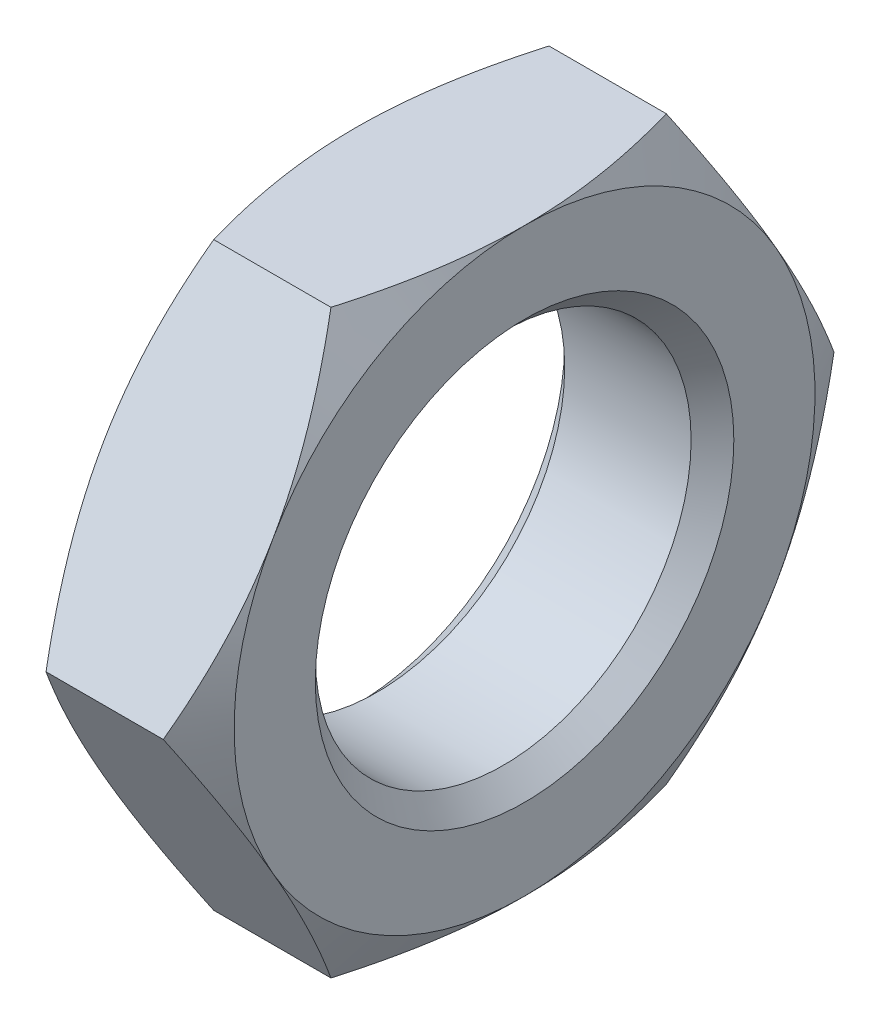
ISO-10303-21;
HEADER;
FILE_DESCRIPTION(('STEP AP214'),'2;1');
FILE_NAME('part.step','',(''),(''),'','','');
FILE_SCHEMA(('AUTOMOTIVE_DESIGN { 1 0 10303 214 1 1 1 1 }'));
ENDSEC;
DATA;
#1=APPLICATION_CONTEXT('core data for automotive mechanical design processes');
#2=APPLICATION_PROTOCOL_DEFINITION('international standard','automotive_design',2000,#1);
#3=PRODUCT_CONTEXT('',#1,'mechanical');
#4=PRODUCT('Part','Part','',(#3));
#5=PRODUCT_RELATED_PRODUCT_CATEGORY('part','',(#4));
#6=PRODUCT_DEFINITION_FORMATION('','',#4);
#7=PRODUCT_DEFINITION_CONTEXT('part definition',#1,'design');
#8=PRODUCT_DEFINITION('design','',#6,#7);
#9=PRODUCT_DEFINITION_SHAPE('','',#8);
#10=(LENGTH_UNIT() NAMED_UNIT(*) SI_UNIT(.MILLI.,.METRE.));
#11=(NAMED_UNIT(*) PLANE_ANGLE_UNIT() SI_UNIT($,.RADIAN.));
#12=(NAMED_UNIT(*) SI_UNIT($,.STERADIAN.) SOLID_ANGLE_UNIT());
#13=UNCERTAINTY_MEASURE_WITH_UNIT(LENGTH_MEASURE(1.E-05),#10,'distance_accuracy_value','');
#14=(GEOMETRIC_REPRESENTATION_CONTEXT(3) GLOBAL_UNCERTAINTY_ASSIGNED_CONTEXT((#13)) GLOBAL_UNIT_ASSIGNED_CONTEXT((#10,
#11,#12)) REPRESENTATION_CONTEXT('',''));
#15=CARTESIAN_POINT('',(0.,0.,0.));
#16=DIRECTION('',(0.,0.,1.));
#17=DIRECTION('',(1.,0.,0.));
#18=AXIS2_PLACEMENT_3D('',#15,#16,#17);
#19=CARTESIAN_POINT('',(9.9,17.,-9.81495457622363));
#20=DIRECTION('',(1.,0.,0.));
#21=DIRECTION('',(0.,0.,-1.));
#22=AXIS2_PLACEMENT_3D('',#19,#20,#21);
#23=PLANE('',#22);
#24=CARTESIAN_POINT('',(9.9,0.,0.));
#25=DIRECTION('',(1.,0.,0.));
#26=DIRECTION('',(0.,0.,-1.));
#27=AXIS2_PLACEMENT_3D('',#24,#25,#26);
#28=CIRCLE('',#27,12.25);
#29=CARTESIAN_POINT('',(9.9,0.,-12.25));
#30=VERTEX_POINT('',#29);
#31=EDGE_CURVE('E11',#30,#30,#28,.F.);
#32=ORIENTED_EDGE('',*,*,#31,.T.);
#33=EDGE_LOOP('',(#32));
#34=FACE_BOUND('',#33,.T.);
#35=CARTESIAN_POINT('',(9.9,0.,0.));
#36=DIRECTION('',(1.,0.,0.));
#37=DIRECTION('',(0.,0.,-1.));
#38=AXIS2_PLACEMENT_3D('',#35,#36,#37);
#39=CIRCLE('',#38,17.);
#40=CARTESIAN_POINT('',(9.9,-17.,0.));
#41=VERTEX_POINT('',#40);
#42=CARTESIAN_POINT('',(9.9,-8.5,-14.7224318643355));
#43=VERTEX_POINT('',#42);
#44=EDGE_CURVE('E142',#41,#43,#39,.T.);
#45=ORIENTED_EDGE('',*,*,#44,.T.);
#46=CARTESIAN_POINT('',(9.9,8.5,-14.7224318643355));
#47=VERTEX_POINT('',#46);
#48=EDGE_CURVE('E130',#43,#47,#39,.T.);
#49=ORIENTED_EDGE('',*,*,#48,.T.);
#50=CARTESIAN_POINT('',(9.9,17.,0.));
#51=VERTEX_POINT('',#50);
#52=EDGE_CURVE('E144',#47,#51,#39,.T.);
#53=ORIENTED_EDGE('',*,*,#52,.T.);
#54=CARTESIAN_POINT('',(9.9,8.5,14.7224318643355));
#55=VERTEX_POINT('',#54);
#56=EDGE_CURVE('E55',#51,#55,#39,.T.);
#57=ORIENTED_EDGE('',*,*,#56,.T.);
#58=CARTESIAN_POINT('',(9.9,-8.5,14.7224318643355));
#59=VERTEX_POINT('',#58);
#60=EDGE_CURVE('E63',#55,#59,#39,.T.);
#61=ORIENTED_EDGE('',*,*,#60,.T.);
#62=EDGE_CURVE('E166',#59,#41,#39,.T.);
#63=ORIENTED_EDGE('',*,*,#62,.T.);
#64=EDGE_LOOP('',(#45,#49,#53,#57,#61,#63));
#65=FACE_BOUND('',#64,.T.);
#66=ADVANCED_FACE('F39',(#34,#65),#23,.T.);
#67=CARTESIAN_POINT('',(0.,17.,-9.81495457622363));
#68=DIRECTION('',(1.,0.,0.));
#69=DIRECTION('',(0.,0.,-1.));
#70=AXIS2_PLACEMENT_3D('',#67,#68,#69);
#71=PLANE('',#70);
#72=CARTESIAN_POINT('',(0.,0.,0.));
#73=DIRECTION('',(1.,0.,0.));
#74=DIRECTION('',(0.,0.,-1.));
#75=AXIS2_PLACEMENT_3D('',#72,#73,#74);
#76=CIRCLE('',#75,12.25);
#77=CARTESIAN_POINT('',(0.,0.,-12.25));
#78=VERTEX_POINT('',#77);
#79=EDGE_CURVE('E164',#78,#78,#76,.T.);
#80=ORIENTED_EDGE('',*,*,#79,.T.);
#81=EDGE_LOOP('',(#80));
#82=FACE_BOUND('',#81,.T.);
#83=CARTESIAN_POINT('',(0.,0.,0.));
#84=DIRECTION('',(1.,0.,0.));
#85=DIRECTION('',(0.,0.,-1.));
#86=AXIS2_PLACEMENT_3D('',#83,#84,#85);
#87=CIRCLE('',#86,17.);
#88=CARTESIAN_POINT('',(0.,-8.5,-14.7224318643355));
#89=VERTEX_POINT('',#88);
#90=CARTESIAN_POINT('',(0.,8.5,-14.7224318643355));
#91=VERTEX_POINT('',#90);
#92=EDGE_CURVE('E172',#89,#91,#87,.T.);
#93=ORIENTED_EDGE('',*,*,#92,.F.);
#94=CARTESIAN_POINT('',(0.,-17.,0.));
#95=VERTEX_POINT('',#94);
#96=EDGE_CURVE('E320',#95,#89,#87,.T.);
#97=ORIENTED_EDGE('',*,*,#96,.F.);
#98=CARTESIAN_POINT('',(0.,-8.5,14.7224318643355));
#99=VERTEX_POINT('',#98);
#100=EDGE_CURVE('E323',#99,#95,#87,.T.);
#101=ORIENTED_EDGE('',*,*,#100,.F.);
#102=CARTESIAN_POINT('',(0.,8.5,14.7224318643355));
#103=VERTEX_POINT('',#102);
#104=EDGE_CURVE('E328',#103,#99,#87,.T.);
#105=ORIENTED_EDGE('',*,*,#104,.F.);
#106=CARTESIAN_POINT('',(0.,17.,0.));
#107=VERTEX_POINT('',#106);
#108=EDGE_CURVE('E177',#107,#103,#87,.T.);
#109=ORIENTED_EDGE('',*,*,#108,.F.);
#110=EDGE_CURVE('E173',#91,#107,#87,.T.);
#111=ORIENTED_EDGE('',*,*,#110,.F.);
#112=EDGE_LOOP('',(#93,#97,#101,#105,#109,#111));
#113=FACE_BOUND('',#112,.T.);
#114=ADVANCED_FACE('F321',(#82,#113),#71,.F.);
#115=CARTESIAN_POINT('',(9.9,0.,0.));
#116=DIRECTION('',(-1.,0.,0.));
#117=DIRECTION('',(0.,0.,1.));
#118=AXIS2_PLACEMENT_3D('',#115,#116,#117);
#119=CYLINDRICAL_SURFACE('',#118,11.);
#120=CARTESIAN_POINT('',(1.24999999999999,0.,0.));
#121=DIRECTION('',(1.,0.,0.));
#122=DIRECTION('',(0.,0.,-1.));
#123=AXIS2_PLACEMENT_3D('',#120,#121,#122);
#124=CIRCLE('',#123,11.);
#125=CARTESIAN_POINT('',(1.24999999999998,0.,11.));
#126=VERTEX_POINT('',#125);
#127=EDGE_CURVE('E48',#126,#126,#124,.F.);
#128=CARTESIAN_POINT('',(8.64999999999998,0.,0.));
#129=DIRECTION('',(1.,0.,0.));
#130=DIRECTION('',(0.,0.,-1.));
#131=AXIS2_PLACEMENT_3D('',#128,#129,#130);
#132=CIRCLE('',#131,11.);
#133=CARTESIAN_POINT('',(8.64999999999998,0.,11.));
#134=VERTEX_POINT('',#133);
#135=EDGE_CURVE('E391',#134,#134,#132,.T.);
#136=CARTESIAN_POINT('',(1.24999999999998,0.,11.));
#137=CARTESIAN_POINT('',(1.32708333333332,0.,11.));
#138=CARTESIAN_POINT('',(1.40416666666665,0.,11.));
#139=CARTESIAN_POINT('',(1.55833333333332,0.,11.));
#140=CARTESIAN_POINT('',(1.63541666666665,0.,11.));
#141=CARTESIAN_POINT('',(1.78958333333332,0.,11.));
#142=CARTESIAN_POINT('',(1.86666666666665,0.,11.));
#143=CARTESIAN_POINT('',(2.02083333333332,0.,11.));
#144=CARTESIAN_POINT('',(2.09791666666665,0.,11.));
#145=CARTESIAN_POINT('',(2.25208333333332,0.,11.));
#146=CARTESIAN_POINT('',(2.32916666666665,0.,11.));
#147=CARTESIAN_POINT('',(2.48333333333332,0.,11.));
#148=CARTESIAN_POINT('',(2.56041666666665,0.,11.));
#149=CARTESIAN_POINT('',(2.71458333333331,0.,11.));
#150=CARTESIAN_POINT('',(2.79166666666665,0.,11.));
#151=CARTESIAN_POINT('',(2.94583333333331,0.,11.));
#152=CARTESIAN_POINT('',(3.02291666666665,0.,11.));
#153=CARTESIAN_POINT('',(3.17708333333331,0.,11.));
#154=CARTESIAN_POINT('',(3.25416666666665,0.,11.));
#155=CARTESIAN_POINT('',(3.40833333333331,0.,11.));
#156=CARTESIAN_POINT('',(3.48541666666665,0.,11.));
#157=CARTESIAN_POINT('',(3.63958333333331,0.,11.));
#158=CARTESIAN_POINT('',(3.71666666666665,0.,11.));
#159=CARTESIAN_POINT('',(3.87083333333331,0.,11.));
#160=CARTESIAN_POINT('',(3.94791666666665,0.,11.));
#161=CARTESIAN_POINT('',(4.10208333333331,0.,11.));
#162=CARTESIAN_POINT('',(4.17916666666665,0.,11.));
#163=CARTESIAN_POINT('',(4.33333333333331,0.,11.));
#164=CARTESIAN_POINT('',(4.41041666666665,0.,11.));
#165=CARTESIAN_POINT('',(4.56458333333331,0.,11.));
#166=CARTESIAN_POINT('',(4.64166666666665,0.,11.));
#167=CARTESIAN_POINT('',(4.79583333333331,0.,11.));
#168=CARTESIAN_POINT('',(4.87291666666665,0.,11.));
#169=CARTESIAN_POINT('',(5.02708333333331,0.,11.));
#170=CARTESIAN_POINT('',(5.10416666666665,0.,11.));
#171=CARTESIAN_POINT('',(5.25833333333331,0.,11.));
#172=CARTESIAN_POINT('',(5.33541666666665,0.,11.));
#173=CARTESIAN_POINT('',(5.48958333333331,0.,11.));
#174=CARTESIAN_POINT('',(5.56666666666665,0.,11.));
#175=CARTESIAN_POINT('',(5.72083333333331,0.,11.));
#176=CARTESIAN_POINT('',(5.79791666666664,0.,11.));
#177=CARTESIAN_POINT('',(5.95208333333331,0.,11.));
#178=CARTESIAN_POINT('',(6.02916666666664,0.,11.));
#179=CARTESIAN_POINT('',(6.18333333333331,0.,11.));
#180=CARTESIAN_POINT('',(6.26041666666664,0.,11.));
#181=CARTESIAN_POINT('',(6.41458333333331,0.,11.));
#182=CARTESIAN_POINT('',(6.49166666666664,0.,11.));
#183=CARTESIAN_POINT('',(6.64583333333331,0.,11.));
#184=CARTESIAN_POINT('',(6.72291666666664,0.,11.));
#185=CARTESIAN_POINT('',(6.87708333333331,0.,11.));
#186=CARTESIAN_POINT('',(6.95416666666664,0.,11.));
#187=CARTESIAN_POINT('',(7.10833333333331,0.,11.));
#188=CARTESIAN_POINT('',(7.18541666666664,0.,11.));
#189=CARTESIAN_POINT('',(7.33958333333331,0.,11.));
#190=CARTESIAN_POINT('',(7.41666666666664,0.,11.));
#191=CARTESIAN_POINT('',(7.57083333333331,0.,11.));
#192=CARTESIAN_POINT('',(7.64791666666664,0.,11.));
#193=CARTESIAN_POINT('',(7.80208333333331,0.,11.));
#194=CARTESIAN_POINT('',(7.87916666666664,0.,11.));
#195=CARTESIAN_POINT('',(8.03333333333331,0.,11.));
#196=CARTESIAN_POINT('',(8.11041666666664,0.,11.));
#197=CARTESIAN_POINT('',(8.26458333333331,0.,11.));
#198=CARTESIAN_POINT('',(8.34166666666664,0.,11.));
#199=CARTESIAN_POINT('',(8.49583333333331,0.,11.));
#200=CARTESIAN_POINT('',(8.57291666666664,0.,11.));
#201=CARTESIAN_POINT('',(8.64999999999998,0.,11.));
#202=B_SPLINE_CURVE_WITH_KNOTS('',3,(#136,#137,#138,#139,#140,#141,#142,#143,#144,#145,#146,
#147,#148,#149,#150,#151,#152,#153,#154,#155,#156,#157,#158,#159,#160,#161,#162,#163,#164,#165,
#166,#167,#168,#169,#170,#171,#172,#173,#174,#175,#176,#177,#178,#179,#180,#181,#182,#183,#184,
#185,#186,#187,#188,#189,#190,#191,#192,#193,#194,#195,#196,#197,#198,#199,#200,#201),
.UNSPECIFIED.,.F.,.F.,(4,2,2,2,2,2,2,2,2,2,2,2,2,2,2,2,2,2,2,2,2,2,2,2,2,2,2,2,2,2,2,2,4),(0.,
0.231250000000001,0.462499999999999,0.69375,0.924999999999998,1.15625,1.3875,1.61875,1.85,
2.08125,2.3125,2.54375,2.775,3.00625,3.2375,3.46875,3.7,3.93125,4.1625,4.39374999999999,
4.62499999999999,4.85624999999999,5.0875,5.31874999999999,5.54999999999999,5.78124999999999,
6.01249999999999,6.24374999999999,6.47499999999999,6.70624999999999,6.93749999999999,
7.16874999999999,7.39999999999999),.UNSPECIFIED.);
#203=EDGE_CURVE('BSEAM233',#126,#134,#202,.T.);
#204=ORIENTED_EDGE('',*,*,#127,.T.);
#205=ORIENTED_EDGE('',*,*,#135,.T.);
#206=ORIENTED_EDGE('',*,*,#203,.T.);
#207=ORIENTED_EDGE('',*,*,#203,.F.);
#208=EDGE_LOOP('',(#204,#206,#205,#207));
#209=FACE_BOUND('',#208,.T.);
#210=ADVANCED_FACE('F233',(#209),#119,.F.);
#211=CARTESIAN_POINT('',(0.,0.,0.));
#212=DIRECTION('',(1.,0.,0.));
#213=DIRECTION('',(0.,0.,-1.));
#214=AXIS2_PLACEMENT_3D('',#211,#212,#213);
#215=CONICAL_SURFACE('',#214,17.,1.0471975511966);
#216=CARTESIAN_POINT('',(1.51844542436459,-17.0002,-9.8148391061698));
#217=CARTESIAN_POINT('',(1.39390284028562,-16.6265469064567,-10.0305678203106));
#218=CARTESIAN_POINT('',(1.27501178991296,-16.251436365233,-10.2471379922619));
#219=CARTESIAN_POINT('',(1.05010368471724,-15.4982073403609,-10.6820149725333));
#220=CARTESIAN_POINT('',(0.944090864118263,-15.1200879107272,-10.9003223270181));
#221=CARTESIAN_POINT('',(0.746364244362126,-14.3601103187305,-11.3390955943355));
#222=CARTESIAN_POINT('',(0.65468427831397,-13.9782455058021,-11.5595653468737));
#223=CARTESIAN_POINT('',(0.487592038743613,-13.2118624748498,-12.0020367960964));
#224=CARTESIAN_POINT('',(0.412178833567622,-12.8273444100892,-12.2240384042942));
#225=CARTESIAN_POINT('',(0.280827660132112,-12.0655075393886,-12.6638851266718));
#226=CARTESIAN_POINT('',(0.224454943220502,-11.6882452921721,-12.8816975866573));
#227=CARTESIAN_POINT('',(0.129930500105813,-10.931992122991,-13.3183205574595));
#228=CARTESIAN_POINT('',(0.0917791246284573,-10.5530011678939,-13.5371310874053));
#229=CARTESIAN_POINT('',(0.0346606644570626,-9.79438261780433,-13.9751197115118));
#230=CARTESIAN_POINT('',(0.0156707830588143,-9.41475631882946,-14.1942970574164));
#231=CARTESIAN_POINT('',(-0.00271629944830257,-8.65515330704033,-14.6328540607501));
#232=CARTESIAN_POINT('',(-0.00211410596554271,-8.27517660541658,-14.8522337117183));
#233=CARTESIAN_POINT('',(0.0173147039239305,-7.56480067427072,-15.2623694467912));
#234=CARTESIAN_POINT('',(0.0337721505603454,-7.23435083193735,-15.4531547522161));
#235=CARTESIAN_POINT('',(0.0811925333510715,-6.57423939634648,-15.8342702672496));
#236=CARTESIAN_POINT('',(0.112155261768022,-6.24457779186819,-16.0246004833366));
#237=CARTESIAN_POINT('',(0.188048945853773,-5.58616773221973,-16.4047337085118));
#238=CARTESIAN_POINT('',(0.232992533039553,-5.25742037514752,-16.5945360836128));
#239=CARTESIAN_POINT('',(0.336054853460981,-4.60149064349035,-16.9732372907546));
#240=CARTESIAN_POINT('',(0.394173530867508,-4.27430826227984,-17.1621361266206));
#241=CARTESIAN_POINT('',(0.589770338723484,-3.28110391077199,-17.7355629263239));
#242=CARTESIAN_POINT('',(0.746752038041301,-2.61795816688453,-18.1184303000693));
#243=CARTESIAN_POINT('',(1.10303610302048,-1.30155488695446,-18.878456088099));
#244=CARTESIAN_POINT('',(1.30225479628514,-0.648280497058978,-19.2556242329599));
#245=CARTESIAN_POINT('',(1.51844542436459,0.000199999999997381,-19.6300246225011));
#246=B_SPLINE_CURVE_WITH_KNOTS('',3,(#216,#217,#218,#219,#220,#221,#222,#223,#224,#225,#226,
#227,#228,#229,#230,#231,#232,#233,#234,#235,#236,#237,#238,#239,#240,#241,#242,#243,#244,#245),
.UNSPECIFIED.,.F.,.F.,(4,2,2,2,2,2,2,2,2,2,2,2,2,2,4),(0.,1.34725361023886,2.6949489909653,
4.04577911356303,5.3965318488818,6.71394507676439,8.03138366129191,9.3472530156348,
10.6630817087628,11.808581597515,12.9540650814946,14.1005865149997,15.2471030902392,
17.590639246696,19.929575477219),.UNSPECIFIED.);
#247=CARTESIAN_POINT('',(1.51837875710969,0.,-19.6299091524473));
#248=VERTEX_POINT('',#247);
#249=EDGE_CURVE('E335',#89,#248,#246,.T.);
#250=ORIENTED_EDGE('',*,*,#249,.F.);
#251=ORIENTED_EDGE('',*,*,#92,.T.);
#252=CARTESIAN_POINT('',(1.51844542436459,-0.000200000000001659,-19.6300246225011));
#253=CARTESIAN_POINT('',(1.39390284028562,0.373453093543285,-19.4142959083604));
#254=CARTESIAN_POINT('',(1.27501178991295,0.748563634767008,-19.197725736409));
#255=CARTESIAN_POINT('',(1.05010368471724,1.50179265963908,-18.7628487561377));
#256=CARTESIAN_POINT('',(0.944090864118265,1.87991208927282,-18.5445414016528));
#257=CARTESIAN_POINT('',(0.746364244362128,2.63988968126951,-18.1057681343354));
#258=CARTESIAN_POINT('',(0.65468427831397,3.02175449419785,-17.8852983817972));
#259=CARTESIAN_POINT('',(0.487592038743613,3.78813752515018,-17.4428269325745));
#260=CARTESIAN_POINT('',(0.412178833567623,4.1726555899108,-17.2208253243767));
#261=CARTESIAN_POINT('',(0.280827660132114,4.93449246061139,-16.7809786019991));
#262=CARTESIAN_POINT('',(0.224454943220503,5.31175470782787,-16.5631661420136));
#263=CARTESIAN_POINT('',(0.129930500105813,6.06800787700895,-16.1265431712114));
#264=CARTESIAN_POINT('',(0.0917791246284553,6.44699883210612,-15.9077326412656));
#265=CARTESIAN_POINT('',(0.0346606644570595,7.20561738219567,-15.4697440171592));
#266=CARTESIAN_POINT('',(0.0156707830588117,7.58524368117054,-15.2505666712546));
#267=CARTESIAN_POINT('',(-0.0027162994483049,8.34484669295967,-14.8120096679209));
#268=CARTESIAN_POINT('',(-0.00211410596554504,8.72482339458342,-14.5926300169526));
#269=CARTESIAN_POINT('',(0.0173147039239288,9.43519932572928,-14.1824942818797));
#270=CARTESIAN_POINT('',(0.0337721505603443,9.76564916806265,-13.9917089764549));
#271=CARTESIAN_POINT('',(0.0811925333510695,10.4257606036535,-13.6105934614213));
#272=CARTESIAN_POINT('',(0.112155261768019,10.7554222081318,-13.4202632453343));
#273=CARTESIAN_POINT('',(0.188048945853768,11.4138322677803,-13.0401300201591));
#274=CARTESIAN_POINT('',(0.232992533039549,11.7425796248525,-12.8503276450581));
#275=CARTESIAN_POINT('',(0.336054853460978,12.3985093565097,-12.4716264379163));
#276=CARTESIAN_POINT('',(0.394173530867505,12.7256917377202,-12.2827276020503));
#277=CARTESIAN_POINT('',(0.589770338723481,13.718896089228,-11.709300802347));
#278=CARTESIAN_POINT('',(0.746752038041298,14.3820418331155,-11.3264334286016));
#279=CARTESIAN_POINT('',(1.10303610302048,15.6984451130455,-10.5664076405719));
#280=CARTESIAN_POINT('',(1.30225479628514,16.351719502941,-10.189239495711));
#281=CARTESIAN_POINT('',(1.51844542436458,17.0002,-9.8148391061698));
#282=B_SPLINE_CURVE_WITH_KNOTS('',3,(#252,#253,#254,#255,#256,#257,#258,#259,#260,#261,#262,
#263,#264,#265,#266,#267,#268,#269,#270,#271,#272,#273,#274,#275,#276,#277,#278,#279,#280,#281),
.UNSPECIFIED.,.F.,.F.,(4,2,2,2,2,2,2,2,2,2,2,2,2,2,4),(0.,1.34725361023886,2.6949489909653,
4.04577911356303,5.3965318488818,6.7139450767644,8.03138366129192,9.3472530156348,
10.6630817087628,11.808581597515,12.9540650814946,14.1005865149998,15.2471030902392,
17.590639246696,19.929575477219),.UNSPECIFIED.);
#283=EDGE_CURVE('E214',#248,#91,#282,.T.);
#284=ORIENTED_EDGE('',*,*,#283,.F.);
#285=EDGE_LOOP('',(#250,#251,#284));
#286=FACE_BOUND('',#285,.T.);
#287=ADVANCED_FACE('F193',(#286),#215,.T.);
#288=ORIENTED_EDGE('',*,*,#96,.T.);
#289=CARTESIAN_POINT('',(1.51837875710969,-17.,-9.81495457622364));
#290=VERTEX_POINT('',#289);
#291=EDGE_CURVE('E156',#290,#89,#246,.T.);
#292=ORIENTED_EDGE('',*,*,#291,.F.);
#293=CARTESIAN_POINT('',(8.36712573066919,-17.,-26.509698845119));
#294=CARTESIAN_POINT('',(8.18641093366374,-17.,-26.1378535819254));
#295=CARTESIAN_POINT('',(8.00658631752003,-17.,-25.76557589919));
#296=CARTESIAN_POINT('',(7.64891876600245,-17.,-25.0200655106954));
#297=CARTESIAN_POINT('',(7.47107585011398,-17.,-24.6468327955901));
#298=CARTESIAN_POINT('',(6.94077569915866,-17.,-23.5254694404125));
#299=CARTESIAN_POINT('',(6.59159956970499,-17.,-22.7757813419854));
#300=CARTESIAN_POINT('',(5.90223181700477,-17.,-21.2674261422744));
#301=CARTESIAN_POINT('',(5.56209820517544,-17.,-20.5087324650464));
#302=CARTESIAN_POINT('',(4.89555117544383,-17.,-18.985362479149));
#303=CARTESIAN_POINT('',(4.56913711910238,-17.,-18.2206864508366));
#304=CARTESIAN_POINT('',(3.92320181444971,-17.,-16.6588611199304));
#305=CARTESIAN_POINT('',(3.60426019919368,-17.,-15.8614708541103));
#306=CARTESIAN_POINT('',(2.99016387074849,-17.,-14.2574095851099));
#307=CARTESIAN_POINT('',(2.69501180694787,-17.,-13.4507375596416));
#308=CARTESIAN_POINT('',(2.13614126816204,-17.,-11.8283189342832));
#309=CARTESIAN_POINT('',(1.87236039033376,-17.,-11.0125940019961));
#310=CARTESIAN_POINT('',(1.38458485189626,-17.,-9.36936646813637));
#311=CARTESIAN_POINT('',(1.16057781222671,-17.,-8.54186761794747));
#312=CARTESIAN_POINT('',(0.863048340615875,-17.,-7.29393880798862));
#313=CARTESIAN_POINT('',(0.770490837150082,-17.,-6.87802060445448));
#314=CARTESIAN_POINT('',(0.59928989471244,-17.,-6.043315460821));
#315=CARTESIAN_POINT('',(0.52064617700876,-17.,-5.62452857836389));
#316=CARTESIAN_POINT('',(0.378651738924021,-17.,-4.78436323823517));
#317=CARTESIAN_POINT('',(0.315300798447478,-17.,-4.36298481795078));
#318=CARTESIAN_POINT('',(0.20515054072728,-17.,-3.51807372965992));
#319=CARTESIAN_POINT('',(0.158350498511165,-17.,-3.09454115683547));
#320=CARTESIAN_POINT('',(0.0828262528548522,-17.,-2.25150377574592));
#321=CARTESIAN_POINT('',(0.0538711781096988,-17.,-1.83201977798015));
#322=CARTESIAN_POINT('',(0.0137342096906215,-17.,-0.992203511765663));
#323=CARTESIAN_POINT('',(0.00255201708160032,-17.,-0.571871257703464));
#324=CARTESIAN_POINT('',(-0.00177262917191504,-17.,0.268889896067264));
#325=CARTESIAN_POINT('',(0.00508495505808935,-17.,0.689318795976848));
#326=CARTESIAN_POINT('',(0.0366707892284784,-17.,1.52950959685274));
#327=CARTESIAN_POINT('',(0.0613998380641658,-17.,1.94927146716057));
#328=CARTESIAN_POINT('',(0.141428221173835,-17.,2.95372004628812));
#329=CARTESIAN_POINT('',(0.204963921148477,-17.,3.53776237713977));
#330=CARTESIAN_POINT('',(0.363206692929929,-17.,4.70161131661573));
#331=CARTESIAN_POINT('',(0.457917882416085,-17.,5.28141735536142));
#332=CARTESIAN_POINT('',(0.675142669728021,-17.,6.43620754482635));
#333=CARTESIAN_POINT('',(0.79767752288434,-17.,7.01118765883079));
#334=CARTESIAN_POINT('',(1.06680214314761,-17.,8.1554287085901));
#335=CARTESIAN_POINT('',(1.21339157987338,-17.,8.72468972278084));
#336=CARTESIAN_POINT('',(1.53053594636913,-17.,9.87008988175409));
#337=CARTESIAN_POINT('',(1.70155109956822,-17.,10.4461007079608));
#338=CARTESIAN_POINT('',(2.06154244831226,-17.,11.5924501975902));
#339=CARTESIAN_POINT('',(2.25051876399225,-17.,12.1627888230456));
#340=CARTESIAN_POINT('',(2.64340648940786,-17.,13.2980705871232));
#341=CARTESIAN_POINT('',(2.84731312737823,-17.,13.8630153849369));
#342=CARTESIAN_POINT('',(3.26763408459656,-17.,14.9882044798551));
#343=CARTESIAN_POINT('',(3.48404824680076,-17.,15.548448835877));
#344=CARTESIAN_POINT('',(4.01478667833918,-17.,16.8850540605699));
#345=CARTESIAN_POINT('',(4.33404636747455,-17.,17.6594523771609));
#346=CARTESIAN_POINT('',(4.98848201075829,-17.,19.2015150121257));
#347=CARTESIAN_POINT('',(5.3236590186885,-17.,19.9691788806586));
#348=CARTESIAN_POINT('',(6.00669603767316,-17.,21.4990484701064));
#349=CARTESIAN_POINT('',(6.35455906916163,-17.,22.2612528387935));
#350=CARTESIAN_POINT('',(7.06036965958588,-17.,23.7809444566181));
#351=CARTESIAN_POINT('',(7.41831698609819,-17.,24.538431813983));
#352=CARTESIAN_POINT('',(8.14280107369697,-17.,26.0503533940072));
#353=CARTESIAN_POINT('',(8.5093472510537,-17.,26.8047830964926));
#354=CARTESIAN_POINT('',(9.24914466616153,-17.,28.310347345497));
#355=CARTESIAN_POINT('',(9.62239593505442,-17.,29.0614818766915));
#356=CARTESIAN_POINT('',(10.3743885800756,-17.,30.5608675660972));
#357=CARTESIAN_POINT('',(10.7531292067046,-17.,31.3091191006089));
#358=CARTESIAN_POINT('',(11.5152384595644,-17.,32.8032572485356));
#359=CARTESIAN_POINT('',(11.8986070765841,-17.,33.5491438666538));
#360=CARTESIAN_POINT('',(12.9883829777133,-17.,35.6559078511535));
#361=CARTESIAN_POINT('',(13.6993363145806,-17.,37.0144335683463));
#362=CARTESIAN_POINT('',(15.1309126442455,-17.,39.7264341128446));
#363=CARTESIAN_POINT('',(15.851536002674,-17.,41.0799087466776));
#364=CARTESIAN_POINT('',(17.2982822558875,-17.,43.7793799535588));
#365=CARTESIAN_POINT('',(18.024385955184,-17.,45.125386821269));
#366=CARTESIAN_POINT('',(19.1178248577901,-17.,47.1420218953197));
#367=CARTESIAN_POINT('',(19.4830079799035,-17.,47.813818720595));
#368=CARTESIAN_POINT('',(20.2146585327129,-17.,49.1567113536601));
#369=CARTESIAN_POINT('',(20.5811259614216,-17.,49.8278071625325));
#370=CARTESIAN_POINT('',(20.9481610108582,-17.,50.4985924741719));
#371=B_SPLINE_CURVE_WITH_KNOTS('',3,(#293,#294,#295,#296,#297,#298,#299,#300,#301,#302,#303,
#304,#305,#306,#307,#308,#309,#310,#311,#312,#313,#314,#315,#316,#317,#318,#319,#320,#321,#322,
#323,#324,#325,#326,#327,#328,#329,#330,#331,#332,#333,#334,#335,#336,#337,#338,#339,#340,#341,
#342,#343,#344,#345,#346,#347,#348,#349,#350,#351,#352,#353,#354,#355,#356,#357,#358,#359,#360,
#361,#362,#363,#364,#365,#366,#367,#368,#369,#370),.UNSPECIFIED.,.F.,.F.,(4,2,2,2,2,2,2,2,2,2,2,
2,2,2,2,2,2,2,2,2,2,2,2,2,2,2,2,2,2,2,2,2,2,2,2,2,2,2,4),(0.,1.24029640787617,2.48060500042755,
4.96158176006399,7.45582199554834,9.94994603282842,12.5260868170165,15.1025141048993,
17.6737275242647,20.2441392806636,21.5222218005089,22.8002787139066,24.0783172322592,
25.3562997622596,26.6173806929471,27.8784404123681,29.1395027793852,30.4006215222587,
32.1621142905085,33.9238398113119,35.6869157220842,37.4499674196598,39.2522027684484,
41.054450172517,42.8561240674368,44.6577753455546,47.17041361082,49.6832184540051,
52.1966255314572,54.7099747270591,57.2262180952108,59.7424731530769,62.2583878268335,
64.7742974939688,69.3741753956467,73.9742277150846,78.5623073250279,80.8562171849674,
83.1501234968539),.UNSPECIFIED.);
#372=EDGE_CURVE('E176',#95,#290,#371,.F.);
#373=ORIENTED_EDGE('',*,*,#372,.F.);
#374=EDGE_LOOP('',(#288,#292,#373));
#375=FACE_BOUND('',#374,.T.);
#376=ADVANCED_FACE('F352',(#375),#215,.T.);
#377=CARTESIAN_POINT('',(4.95,0.,0.));
#378=DIRECTION('',(-1.,0.,0.));
#379=DIRECTION('',(0.,0.,1.));
#380=AXIS2_PLACEMENT_3D('',#377,#378,#379);
#381=CONICAL_SURFACE('',#380,25.573651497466,1.0471975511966);
#382=CARTESIAN_POINT('',(8.38155457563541,0.000199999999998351,-19.6300246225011));
#383=CARTESIAN_POINT('',(8.50609715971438,-0.373453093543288,-19.4142959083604));
#384=CARTESIAN_POINT('',(8.62498821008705,-0.74856363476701,-19.197725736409));
#385=CARTESIAN_POINT('',(8.84989631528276,-1.50179265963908,-18.7628487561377));
#386=CARTESIAN_POINT('',(8.95590913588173,-1.87991208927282,-18.5445414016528));
#387=CARTESIAN_POINT('',(9.15363575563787,-2.63988968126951,-18.1057681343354));
#388=CARTESIAN_POINT('',(9.24531572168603,-3.02175449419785,-17.8852983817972));
#389=CARTESIAN_POINT('',(9.41240796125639,-3.78813752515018,-17.4428269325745));
#390=CARTESIAN_POINT('',(9.48782116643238,-4.1726555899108,-17.2208253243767));
#391=CARTESIAN_POINT('',(9.61917233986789,-4.93449246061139,-16.7809786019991));
#392=CARTESIAN_POINT('',(9.6755450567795,-5.31175470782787,-16.5631661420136));
#393=CARTESIAN_POINT('',(9.77006949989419,-6.06800787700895,-16.1265431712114));
#394=CARTESIAN_POINT('',(9.80822087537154,-6.44699883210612,-15.9077326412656));
#395=CARTESIAN_POINT('',(9.86533933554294,-7.20561738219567,-15.4697440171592));
#396=CARTESIAN_POINT('',(9.88432921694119,-7.58524368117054,-15.2505666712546));
#397=CARTESIAN_POINT('',(9.90271629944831,-8.34484669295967,-14.8120096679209));
#398=CARTESIAN_POINT('',(9.90211410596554,-8.72482339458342,-14.5926300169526));
#399=CARTESIAN_POINT('',(9.88268529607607,-9.43519932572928,-14.1824942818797));
#400=CARTESIAN_POINT('',(9.86622784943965,-9.76564916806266,-13.9917089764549));
#401=CARTESIAN_POINT('',(9.81880746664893,-10.4257606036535,-13.6105934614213));
#402=CARTESIAN_POINT('',(9.78784473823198,-10.7554222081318,-13.4202632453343));
#403=CARTESIAN_POINT('',(9.71195105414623,-11.4138322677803,-13.0401300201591));
#404=CARTESIAN_POINT('',(9.66700746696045,-11.7425796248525,-12.8503276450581));
#405=CARTESIAN_POINT('',(9.56394514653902,-12.3985093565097,-12.4716264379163));
#406=CARTESIAN_POINT('',(9.50582646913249,-12.7256917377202,-12.2827276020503));
#407=CARTESIAN_POINT('',(9.31022966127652,-13.718896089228,-11.709300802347));
#408=CARTESIAN_POINT('',(9.1532479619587,-14.3820418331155,-11.3264334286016));
#409=CARTESIAN_POINT('',(8.79696389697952,-15.6984451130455,-10.5664076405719));
#410=CARTESIAN_POINT('',(8.59774520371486,-16.351719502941,-10.189239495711));
#411=CARTESIAN_POINT('',(8.38155457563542,-17.0002,-9.8148391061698));
#412=B_SPLINE_CURVE_WITH_KNOTS('',3,(#382,#383,#384,#385,#386,#387,#388,#389,#390,#391,#392,
#393,#394,#395,#396,#397,#398,#399,#400,#401,#402,#403,#404,#405,#406,#407,#408,#409,#410,#411),
.UNSPECIFIED.,.F.,.F.,(4,2,2,2,2,2,2,2,2,2,2,2,2,2,4),(0.,1.34725361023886,2.6949489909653,
4.04577911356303,5.3965318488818,6.7139450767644,8.03138366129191,9.3472530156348,
10.6630817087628,11.808581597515,12.9540650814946,14.1005865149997,15.2471030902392,
17.590639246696,19.929575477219),.UNSPECIFIED.);
#413=CARTESIAN_POINT('',(8.38162124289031,-17.,-9.81495457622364));
#414=VERTEX_POINT('',#413);
#415=EDGE_CURVE('E147',#43,#414,#412,.T.);
#416=ORIENTED_EDGE('',*,*,#415,.F.);
#417=ORIENTED_EDGE('',*,*,#44,.F.);
#418=CARTESIAN_POINT('',(1.53287426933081,-17.,-26.509698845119));
#419=CARTESIAN_POINT('',(1.71358906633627,-17.,-26.1378535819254));
#420=CARTESIAN_POINT('',(1.89341368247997,-17.,-25.76557589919));
#421=CARTESIAN_POINT('',(2.25108123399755,-17.,-25.0200655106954));
#422=CARTESIAN_POINT('',(2.42892414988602,-17.,-24.6468327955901));
#423=CARTESIAN_POINT('',(2.95922430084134,-17.,-23.5254694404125));
#424=CARTESIAN_POINT('',(3.30840043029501,-17.,-22.7757813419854));
#425=CARTESIAN_POINT('',(3.99776818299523,-17.,-21.2674261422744));
#426=CARTESIAN_POINT('',(4.33790179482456,-17.,-20.5087324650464));
#427=CARTESIAN_POINT('',(5.00444882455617,-17.,-18.985362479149));
#428=CARTESIAN_POINT('',(5.33086288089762,-17.,-18.2206864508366));
#429=CARTESIAN_POINT('',(5.9767981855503,-17.,-16.6588611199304));
#430=CARTESIAN_POINT('',(6.29573980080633,-17.,-15.8614708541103));
#431=CARTESIAN_POINT('',(6.90983612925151,-17.,-14.2574095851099));
#432=CARTESIAN_POINT('',(7.20498819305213,-17.,-13.4507375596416));
#433=CARTESIAN_POINT('',(7.76385873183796,-17.,-11.8283189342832));
#434=CARTESIAN_POINT('',(8.02763960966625,-17.,-11.0125940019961));
#435=CARTESIAN_POINT('',(8.51541514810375,-17.,-9.36936646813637));
#436=CARTESIAN_POINT('',(8.73942218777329,-17.,-8.54186761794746));
#437=CARTESIAN_POINT('',(9.03695165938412,-17.,-7.29393880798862));
#438=CARTESIAN_POINT('',(9.12950916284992,-17.,-6.87802060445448));
#439=CARTESIAN_POINT('',(9.30071010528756,-17.,-6.043315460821));
#440=CARTESIAN_POINT('',(9.37935382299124,-17.,-5.6245285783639));
#441=CARTESIAN_POINT('',(9.52134826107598,-17.,-4.78436323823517));
#442=CARTESIAN_POINT('',(9.58469920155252,-17.,-4.36298481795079));
#443=CARTESIAN_POINT('',(9.69484945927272,-17.,-3.51807372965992));
#444=CARTESIAN_POINT('',(9.74164950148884,-17.,-3.09454115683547));
#445=CARTESIAN_POINT('',(9.81717374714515,-17.,-2.25150377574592));
#446=CARTESIAN_POINT('',(9.8461288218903,-17.,-1.83201977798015));
#447=CARTESIAN_POINT('',(9.88626579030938,-17.,-0.992203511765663));
#448=CARTESIAN_POINT('',(9.8974479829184,-17.,-0.571871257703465));
#449=CARTESIAN_POINT('',(9.90177262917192,-17.,0.268889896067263));
#450=CARTESIAN_POINT('',(9.89491504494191,-17.,0.689318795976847));
#451=CARTESIAN_POINT('',(9.86332921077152,-17.,1.52950959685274));
#452=CARTESIAN_POINT('',(9.83860016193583,-17.,1.94927146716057));
#453=CARTESIAN_POINT('',(9.75857177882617,-17.,2.95372004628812));
#454=CARTESIAN_POINT('',(9.69503607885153,-17.,3.53776237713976));
#455=CARTESIAN_POINT('',(9.53679330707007,-17.,4.70161131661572));
#456=CARTESIAN_POINT('',(9.44208211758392,-17.,5.28141735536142));
#457=CARTESIAN_POINT('',(9.22485733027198,-17.,6.43620754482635));
#458=CARTESIAN_POINT('',(9.10232247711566,-17.,7.01118765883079));
#459=CARTESIAN_POINT('',(8.83319785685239,-17.,8.1554287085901));
#460=CARTESIAN_POINT('',(8.68660842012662,-17.,8.72468972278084));
#461=CARTESIAN_POINT('',(8.36946405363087,-17.,9.87008988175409));
#462=CARTESIAN_POINT('',(8.19844890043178,-17.,10.4461007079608));
#463=CARTESIAN_POINT('',(7.83845755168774,-17.,11.5924501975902));
#464=CARTESIAN_POINT('',(7.64948123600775,-17.,12.1627888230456));
#465=CARTESIAN_POINT('',(7.25659351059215,-17.,13.2980705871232));
#466=CARTESIAN_POINT('',(7.05268687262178,-17.,13.8630153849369));
#467=CARTESIAN_POINT('',(6.63236591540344,-17.,14.9882044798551));
#468=CARTESIAN_POINT('',(6.41595175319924,-17.,15.548448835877));
#469=CARTESIAN_POINT('',(5.88521332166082,-17.,16.8850540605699));
#470=CARTESIAN_POINT('',(5.56595363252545,-17.,17.6594523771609));
#471=CARTESIAN_POINT('',(4.91151798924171,-17.,19.2015150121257));
#472=CARTESIAN_POINT('',(4.5763409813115,-17.,19.9691788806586));
#473=CARTESIAN_POINT('',(3.89330396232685,-17.,21.4990484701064));
#474=CARTESIAN_POINT('',(3.54544093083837,-17.,22.2612528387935));
#475=CARTESIAN_POINT('',(2.83963034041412,-17.,23.7809444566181));
#476=CARTESIAN_POINT('',(2.48168301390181,-17.,24.538431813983));
#477=CARTESIAN_POINT('',(1.75719892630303,-17.,26.0503533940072));
#478=CARTESIAN_POINT('',(1.3906527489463,-17.,26.8047830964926));
#479=CARTESIAN_POINT('',(0.650855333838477,-17.,28.310347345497));
#480=CARTESIAN_POINT('',(0.27760406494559,-17.,29.0614818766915));
#481=CARTESIAN_POINT('',(-0.474388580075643,-17.,30.5608675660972));
#482=CARTESIAN_POINT('',(-0.853129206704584,-17.,31.3091191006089));
#483=CARTESIAN_POINT('',(-1.61523845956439,-17.,32.8032572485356));
#484=CARTESIAN_POINT('',(-1.99860707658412,-17.,33.5491438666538));
#485=CARTESIAN_POINT('',(-3.08838297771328,-17.,35.6559078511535));
#486=CARTESIAN_POINT('',(-3.79933631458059,-17.,37.0144335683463));
#487=CARTESIAN_POINT('',(-5.23091264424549,-17.,39.7264341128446));
#488=CARTESIAN_POINT('',(-5.95153600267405,-17.,41.0799087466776));
#489=CARTESIAN_POINT('',(-7.39828225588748,-17.,43.7793799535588));
#490=CARTESIAN_POINT('',(-8.12438595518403,-17.,45.125386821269));
#491=CARTESIAN_POINT('',(-9.21782485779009,-17.,47.1420218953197));
#492=CARTESIAN_POINT('',(-9.5830079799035,-17.,47.8138187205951));
#493=CARTESIAN_POINT('',(-10.3146585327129,-17.,49.1567113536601));
#494=CARTESIAN_POINT('',(-10.6811259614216,-17.,49.8278071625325));
#495=CARTESIAN_POINT('',(-11.0481610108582,-17.,50.4985924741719));
#496=B_SPLINE_CURVE_WITH_KNOTS('',3,(#418,#419,#420,#421,#422,#423,#424,#425,#426,#427,#428,
#429,#430,#431,#432,#433,#434,#435,#436,#437,#438,#439,#440,#441,#442,#443,#444,#445,#446,#447,
#448,#449,#450,#451,#452,#453,#454,#455,#456,#457,#458,#459,#460,#461,#462,#463,#464,#465,#466,
#467,#468,#469,#470,#471,#472,#473,#474,#475,#476,#477,#478,#479,#480,#481,#482,#483,#484,#485,
#486,#487,#488,#489,#490,#491,#492,#493,#494,#495),.UNSPECIFIED.,.F.,.F.,(4,2,2,2,2,2,2,2,2,2,2,
2,2,2,2,2,2,2,2,2,2,2,2,2,2,2,2,2,2,2,2,2,2,2,2,2,2,2,4),(0.,1.24029640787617,2.48060500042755,
4.96158176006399,7.45582199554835,9.94994603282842,12.5260868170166,15.1025141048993,
17.6737275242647,20.2441392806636,21.5222218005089,22.8002787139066,24.0783172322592,
25.3562997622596,26.6173806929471,27.8784404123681,29.1395027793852,30.4006215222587,
32.1621142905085,33.9238398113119,35.6869157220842,37.4499674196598,39.2522027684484,
41.0544501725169,42.8561240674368,44.6577753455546,47.17041361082,49.6832184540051,
52.1966255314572,54.709974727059,57.2262180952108,59.7424731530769,62.2583878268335,
64.7742974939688,69.3741753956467,73.9742277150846,78.5623073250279,80.8562171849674,
83.1501234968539),.UNSPECIFIED.);
#497=EDGE_CURVE('E151',#414,#41,#496,.T.);
#498=ORIENTED_EDGE('',*,*,#497,.F.);
#499=EDGE_LOOP('',(#416,#417,#498));
#500=FACE_BOUND('',#499,.T.);
#501=ADVANCED_FACE('F148',(#500),#381,.T.);
#502=ORIENTED_EDGE('',*,*,#48,.F.);
#503=CARTESIAN_POINT('',(8.38162124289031,0.,-19.6299091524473));
#504=VERTEX_POINT('',#503);
#505=EDGE_CURVE('E134',#504,#43,#412,.T.);
#506=ORIENTED_EDGE('',*,*,#505,.F.);
#507=CARTESIAN_POINT('',(8.38155457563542,17.0002,-9.8148391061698));
#508=CARTESIAN_POINT('',(8.50609715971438,16.6265469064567,-10.0305678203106));
#509=CARTESIAN_POINT('',(8.62498821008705,16.251436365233,-10.2471379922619));
#510=CARTESIAN_POINT('',(8.84989631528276,15.4982073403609,-10.6820149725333));
#511=CARTESIAN_POINT('',(8.95590913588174,15.1200879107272,-10.9003223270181));
#512=CARTESIAN_POINT('',(9.15363575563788,14.3601103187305,-11.3390955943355));
#513=CARTESIAN_POINT('',(9.24531572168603,13.9782455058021,-11.5595653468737));
#514=CARTESIAN_POINT('',(9.41240796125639,13.2118624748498,-12.0020367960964));
#515=CARTESIAN_POINT('',(9.48782116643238,12.8273444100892,-12.2240384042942));
#516=CARTESIAN_POINT('',(9.61917233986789,12.0655075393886,-12.6638851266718));
#517=CARTESIAN_POINT('',(9.6755450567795,11.6882452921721,-12.8816975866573));
#518=CARTESIAN_POINT('',(9.77006949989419,10.931992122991,-13.3183205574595));
#519=CARTESIAN_POINT('',(9.80822087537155,10.5530011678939,-13.5371310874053));
#520=CARTESIAN_POINT('',(9.86533933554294,9.79438261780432,-13.9751197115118));
#521=CARTESIAN_POINT('',(9.88432921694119,9.41475631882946,-14.1942970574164));
#522=CARTESIAN_POINT('',(9.90271629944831,8.65515330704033,-14.6328540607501));
#523=CARTESIAN_POINT('',(9.90211410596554,8.27517660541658,-14.8522337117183));
#524=CARTESIAN_POINT('',(9.88268529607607,7.56480067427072,-15.2623694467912));
#525=CARTESIAN_POINT('',(9.86622784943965,7.23435083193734,-15.4531547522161));
#526=CARTESIAN_POINT('',(9.81880746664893,6.57423939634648,-15.8342702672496));
#527=CARTESIAN_POINT('',(9.78784473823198,6.24457779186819,-16.0246004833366));
#528=CARTESIAN_POINT('',(9.71195105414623,5.58616773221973,-16.4047337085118));
#529=CARTESIAN_POINT('',(9.66700746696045,5.25742037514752,-16.5945360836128));
#530=CARTESIAN_POINT('',(9.56394514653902,4.60149064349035,-16.9732372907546));
#531=CARTESIAN_POINT('',(9.5058264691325,4.27430826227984,-17.1621361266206));
#532=CARTESIAN_POINT('',(9.31022966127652,3.28110391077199,-17.7355629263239));
#533=CARTESIAN_POINT('',(9.1532479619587,2.61795816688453,-18.1184303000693));
#534=CARTESIAN_POINT('',(8.79696389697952,1.30155488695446,-18.878456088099));
#535=CARTESIAN_POINT('',(8.59774520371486,0.648280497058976,-19.2556242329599));
#536=CARTESIAN_POINT('',(8.38155457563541,-0.000200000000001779,-19.6300246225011));
#537=B_SPLINE_CURVE_WITH_KNOTS('',3,(#507,#508,#509,#510,#511,#512,#513,#514,#515,#516,#517,
#518,#519,#520,#521,#522,#523,#524,#525,#526,#527,#528,#529,#530,#531,#532,#533,#534,#535,#536),
.UNSPECIFIED.,.F.,.F.,(4,2,2,2,2,2,2,2,2,2,2,2,2,2,4),(0.,1.34725361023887,2.6949489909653,
4.04577911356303,5.3965318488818,6.7139450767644,8.03138366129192,9.3472530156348,
10.6630817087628,11.808581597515,12.9540650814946,14.1005865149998,15.2471030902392,
17.590639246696,19.929575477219),.UNSPECIFIED.);
#538=EDGE_CURVE('E136',#47,#504,#537,.T.);
#539=ORIENTED_EDGE('',*,*,#538,.F.);
#540=EDGE_LOOP('',(#502,#506,#539));
#541=FACE_BOUND('',#540,.T.);
#542=ADVANCED_FACE('F132',(#541),#381,.T.);
#543=ORIENTED_EDGE('',*,*,#100,.T.);
#544=CARTESIAN_POINT('',(1.51837875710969,-17.,9.81495457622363));
#545=VERTEX_POINT('',#544);
#546=EDGE_CURVE('E186',#545,#95,#371,.F.);
#547=ORIENTED_EDGE('',*,*,#546,.F.);
#548=CARTESIAN_POINT('',(1.51844542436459,0.000200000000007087,19.6300246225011));
#549=CARTESIAN_POINT('',(1.39390284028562,-0.37345309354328,19.4142959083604));
#550=CARTESIAN_POINT('',(1.27501178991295,-0.748563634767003,19.197725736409));
#551=CARTESIAN_POINT('',(1.05010368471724,-1.50179265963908,18.7628487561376));
#552=CARTESIAN_POINT('',(0.944090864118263,-1.87991208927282,18.5445414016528));
#553=CARTESIAN_POINT('',(0.746364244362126,-2.6398896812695,18.1057681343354));
#554=CARTESIAN_POINT('',(0.654684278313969,-3.02175449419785,17.8852983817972));
#555=CARTESIAN_POINT('',(0.487592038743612,-3.78813752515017,17.4428269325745));
#556=CARTESIAN_POINT('',(0.412178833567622,-4.17265558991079,17.2208253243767));
#557=CARTESIAN_POINT('',(0.280827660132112,-4.93449246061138,16.7809786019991));
#558=CARTESIAN_POINT('',(0.224454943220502,-5.31175470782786,16.5631661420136));
#559=CARTESIAN_POINT('',(0.129930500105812,-6.06800787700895,16.1265431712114));
#560=CARTESIAN_POINT('',(0.091779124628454,-6.44699883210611,15.9077326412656));
#561=CARTESIAN_POINT('',(0.0346606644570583,-7.20561738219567,15.4697440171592));
#562=CARTESIAN_POINT('',(0.0156707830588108,-7.58524368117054,15.2505666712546));
#563=CARTESIAN_POINT('',(-0.00271629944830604,-8.34484669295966,14.8120096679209));
#564=CARTESIAN_POINT('',(-0.00211410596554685,-8.72482339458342,14.5926300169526));
#565=CARTESIAN_POINT('',(0.0173147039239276,-9.43519932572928,14.1824942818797));
#566=CARTESIAN_POINT('',(0.0337721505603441,-9.76564916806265,13.9917089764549));
#567=CARTESIAN_POINT('',(0.0811925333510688,-10.4257606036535,13.6105934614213));
#568=CARTESIAN_POINT('',(0.112155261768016,-10.7554222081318,13.4202632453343));
#569=CARTESIAN_POINT('',(0.188048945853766,-11.4138322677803,13.0401300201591));
#570=CARTESIAN_POINT('',(0.232992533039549,-11.7425796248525,12.8503276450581));
#571=CARTESIAN_POINT('',(0.336054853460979,-12.3985093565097,12.4716264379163));
#572=CARTESIAN_POINT('',(0.394173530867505,-12.7256917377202,12.2827276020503));
#573=CARTESIAN_POINT('',(0.58977033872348,-13.718896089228,11.709300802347));
#574=CARTESIAN_POINT('',(0.746752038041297,-14.3820418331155,11.3264334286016));
#575=CARTESIAN_POINT('',(1.10303610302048,-15.6984451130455,10.5664076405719));
#576=CARTESIAN_POINT('',(1.30225479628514,-16.351719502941,10.189239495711));
#577=CARTESIAN_POINT('',(1.51844542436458,-17.0002,9.8148391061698));
#578=B_SPLINE_CURVE_WITH_KNOTS('',3,(#548,#549,#550,#551,#552,#553,#554,#555,#556,#557,#558,
#559,#560,#561,#562,#563,#564,#565,#566,#567,#568,#569,#570,#571,#572,#573,#574,#575,#576,#577),
.UNSPECIFIED.,.F.,.F.,(4,2,2,2,2,2,2,2,2,2,2,2,2,2,4),(0.,1.34725361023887,2.6949489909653,
4.04577911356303,5.3965318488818,6.71394507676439,8.03138366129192,9.3472530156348,
10.6630817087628,11.808581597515,12.9540650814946,14.1005865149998,15.2471030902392,
17.590639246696,19.929575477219),.UNSPECIFIED.);
#579=EDGE_CURVE('E187',#99,#545,#578,.T.);
#580=ORIENTED_EDGE('',*,*,#579,.F.);
#581=EDGE_LOOP('',(#543,#547,#580));
#582=FACE_BOUND('',#581,.T.);
#583=ADVANCED_FACE('F351',(#582),#215,.T.);
#584=CARTESIAN_POINT('',(8.38162124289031,-17.,9.81495457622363));
#585=VERTEX_POINT('',#584);
#586=EDGE_CURVE('E215',#41,#585,#496,.T.);
#587=ORIENTED_EDGE('',*,*,#586,.F.);
#588=ORIENTED_EDGE('',*,*,#62,.F.);
#589=CARTESIAN_POINT('',(8.38155457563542,-17.0002,9.8148391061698));
#590=CARTESIAN_POINT('',(8.50609715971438,-16.6265469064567,10.0305678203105));
#591=CARTESIAN_POINT('',(8.62498821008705,-16.251436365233,10.2471379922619));
#592=CARTESIAN_POINT('',(8.84989631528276,-15.4982073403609,10.6820149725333));
#593=CARTESIAN_POINT('',(8.95590913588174,-15.1200879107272,10.9003223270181));
#594=CARTESIAN_POINT('',(9.15363575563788,-14.3601103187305,11.3390955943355));
#595=CARTESIAN_POINT('',(9.24531572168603,-13.9782455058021,11.5595653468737));
#596=CARTESIAN_POINT('',(9.41240796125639,-13.2118624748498,12.0020367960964));
#597=CARTESIAN_POINT('',(9.48782116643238,-12.8273444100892,12.2240384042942));
#598=CARTESIAN_POINT('',(9.61917233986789,-12.0655075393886,12.6638851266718));
#599=CARTESIAN_POINT('',(9.6755450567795,-11.6882452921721,12.8816975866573));
#600=CARTESIAN_POINT('',(9.77006949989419,-10.931992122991,13.3183205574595));
#601=CARTESIAN_POINT('',(9.80822087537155,-10.5530011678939,13.5371310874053));
#602=CARTESIAN_POINT('',(9.86533933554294,-9.79438261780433,13.9751197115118));
#603=CARTESIAN_POINT('',(9.88432921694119,-9.41475631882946,14.1942970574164));
#604=CARTESIAN_POINT('',(9.90271629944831,-8.65515330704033,14.6328540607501));
#605=CARTESIAN_POINT('',(9.90211410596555,-8.27517660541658,14.8522337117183));
#606=CARTESIAN_POINT('',(9.88268529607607,-7.56480067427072,15.2623694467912));
#607=CARTESIAN_POINT('',(9.86622784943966,-7.23435083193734,15.4531547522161));
#608=CARTESIAN_POINT('',(9.81880746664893,-6.57423939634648,15.8342702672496));
#609=CARTESIAN_POINT('',(9.78784473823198,-6.24457779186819,16.0246004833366));
#610=CARTESIAN_POINT('',(9.71195105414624,-5.58616773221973,16.4047337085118));
#611=CARTESIAN_POINT('',(9.66700746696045,-5.25742037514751,16.5945360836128));
#612=CARTESIAN_POINT('',(9.56394514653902,-4.60149064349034,16.9732372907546));
#613=CARTESIAN_POINT('',(9.5058264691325,-4.27430826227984,17.1621361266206));
#614=CARTESIAN_POINT('',(9.31022966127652,-3.28110391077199,17.7355629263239));
#615=CARTESIAN_POINT('',(9.1532479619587,-2.61795816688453,18.1184303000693));
#616=CARTESIAN_POINT('',(8.79696389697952,-1.30155488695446,18.878456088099));
#617=CARTESIAN_POINT('',(8.59774520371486,-0.648280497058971,19.2556242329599));
#618=CARTESIAN_POINT('',(8.38155457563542,0.000200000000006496,19.6300246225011));
#619=B_SPLINE_CURVE_WITH_KNOTS('',3,(#589,#590,#591,#592,#593,#594,#595,#596,#597,#598,#599,
#600,#601,#602,#603,#604,#605,#606,#607,#608,#609,#610,#611,#612,#613,#614,#615,#616,#617,#618),
.UNSPECIFIED.,.F.,.F.,(4,2,2,2,2,2,2,2,2,2,2,2,2,2,4),(0.,1.34725361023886,2.6949489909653,
4.04577911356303,5.39653184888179,6.71394507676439,8.03138366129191,9.3472530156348,
10.6630817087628,11.808581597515,12.9540650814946,14.1005865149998,15.2471030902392,
17.590639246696,19.929575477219),.UNSPECIFIED.);
#620=EDGE_CURVE('E246',#585,#59,#619,.T.);
#621=ORIENTED_EDGE('',*,*,#620,.F.);
#622=EDGE_LOOP('',(#587,#588,#621));
#623=FACE_BOUND('',#622,.T.);
#624=ADVANCED_FACE('F429',(#623),#381,.T.);
#625=ORIENTED_EDGE('',*,*,#104,.T.);
#626=CARTESIAN_POINT('',(1.51837875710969,0.,19.6299091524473));
#627=VERTEX_POINT('',#626);
#628=EDGE_CURVE('E287',#627,#99,#578,.T.);
#629=ORIENTED_EDGE('',*,*,#628,.F.);
#630=CARTESIAN_POINT('',(1.51844542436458,17.0002,9.8148391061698));
#631=CARTESIAN_POINT('',(1.39390284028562,16.6265469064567,10.0305678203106));
#632=CARTESIAN_POINT('',(1.27501178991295,16.251436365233,10.2471379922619));
#633=CARTESIAN_POINT('',(1.05010368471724,15.4982073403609,10.6820149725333));
#634=CARTESIAN_POINT('',(0.944090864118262,15.1200879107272,10.9003223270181));
#635=CARTESIAN_POINT('',(0.746364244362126,14.3601103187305,11.3390955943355));
#636=CARTESIAN_POINT('',(0.65468427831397,13.9782455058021,11.5595653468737));
#637=CARTESIAN_POINT('',(0.487592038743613,13.2118624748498,12.0020367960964));
#638=CARTESIAN_POINT('',(0.412178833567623,12.8273444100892,12.2240384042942));
#639=CARTESIAN_POINT('',(0.280827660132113,12.0655075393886,12.6638851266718));
#640=CARTESIAN_POINT('',(0.224454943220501,11.6882452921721,12.8816975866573));
#641=CARTESIAN_POINT('',(0.129930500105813,10.931992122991,13.3183205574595));
#642=CARTESIAN_POINT('',(0.0917791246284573,10.5530011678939,13.5371310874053));
#643=CARTESIAN_POINT('',(0.034660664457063,9.79438261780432,13.9751197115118));
#644=CARTESIAN_POINT('',(0.0156707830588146,9.41475631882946,14.1942970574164));
#645=CARTESIAN_POINT('',(-0.00271629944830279,8.65515330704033,14.6328540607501));
#646=CARTESIAN_POINT('',(-0.00211410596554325,8.27517660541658,14.8522337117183));
#647=CARTESIAN_POINT('',(0.017314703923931,7.56480067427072,15.2623694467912));
#648=CARTESIAN_POINT('',(0.033772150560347,7.23435083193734,15.4531547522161));
#649=CARTESIAN_POINT('',(0.0811925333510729,6.57423939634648,15.8342702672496));
#650=CARTESIAN_POINT('',(0.112155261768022,6.2445777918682,16.0246004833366));
#651=CARTESIAN_POINT('',(0.188048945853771,5.58616773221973,16.4047337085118));
#652=CARTESIAN_POINT('',(0.232992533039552,5.25742037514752,16.5945360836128));
#653=CARTESIAN_POINT('',(0.33605485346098,4.60149064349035,16.9732372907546));
#654=CARTESIAN_POINT('',(0.394173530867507,4.27430826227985,17.1621361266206));
#655=CARTESIAN_POINT('',(0.589770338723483,3.281103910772,17.7355629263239));
#656=CARTESIAN_POINT('',(0.746752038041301,2.61795816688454,18.1184303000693));
#657=CARTESIAN_POINT('',(1.10303610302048,1.30155488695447,18.878456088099));
#658=CARTESIAN_POINT('',(1.30225479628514,0.648280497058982,19.2556242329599));
#659=CARTESIAN_POINT('',(1.51844542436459,-0.000199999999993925,19.6300246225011));
#660=B_SPLINE_CURVE_WITH_KNOTS('',3,(#630,#631,#632,#633,#634,#635,#636,#637,#638,#639,#640,
#641,#642,#643,#644,#645,#646,#647,#648,#649,#650,#651,#652,#653,#654,#655,#656,#657,#658,#659),
.UNSPECIFIED.,.F.,.F.,(4,2,2,2,2,2,2,2,2,2,2,2,2,2,4),(0.,1.34725361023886,2.6949489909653,
4.04577911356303,5.39653184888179,6.71394507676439,8.03138366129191,9.3472530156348,
10.6630817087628,11.808581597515,12.9540650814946,14.1005865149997,15.2471030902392,
17.590639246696,19.929575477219),.UNSPECIFIED.);
#661=EDGE_CURVE('E281',#103,#627,#660,.T.);
#662=ORIENTED_EDGE('',*,*,#661,.F.);
#663=EDGE_LOOP('',(#625,#629,#662));
#664=FACE_BOUND('',#663,.T.);
#665=ADVANCED_FACE('F231',(#664),#215,.T.);
#666=CARTESIAN_POINT('',(8.38162124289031,0.,19.6299091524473));
#667=VERTEX_POINT('',#666);
#668=EDGE_CURVE('E376',#59,#667,#619,.T.);
#669=ORIENTED_EDGE('',*,*,#668,.F.);
#670=ORIENTED_EDGE('',*,*,#60,.F.);
#671=CARTESIAN_POINT('',(8.38155457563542,-0.000199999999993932,19.6300246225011));
#672=CARTESIAN_POINT('',(8.50609715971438,0.373453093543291,19.4142959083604));
#673=CARTESIAN_POINT('',(8.62498821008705,0.748563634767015,19.197725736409));
#674=CARTESIAN_POINT('',(8.84989631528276,1.50179265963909,18.7628487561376));
#675=CARTESIAN_POINT('',(8.95590913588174,1.87991208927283,18.5445414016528));
#676=CARTESIAN_POINT('',(9.15363575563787,2.63988968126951,18.1057681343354));
#677=CARTESIAN_POINT('',(9.24531572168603,3.02175449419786,17.8852983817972));
#678=CARTESIAN_POINT('',(9.41240796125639,3.78813752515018,17.4428269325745));
#679=CARTESIAN_POINT('',(9.48782116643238,4.17265558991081,17.2208253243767));
#680=CARTESIAN_POINT('',(9.61917233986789,4.9344924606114,16.7809786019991));
#681=CARTESIAN_POINT('',(9.6755450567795,5.31175470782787,16.5631661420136));
#682=CARTESIAN_POINT('',(9.77006949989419,6.06800787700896,16.1265431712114));
#683=CARTESIAN_POINT('',(9.80822087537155,6.44699883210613,15.9077326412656));
#684=CARTESIAN_POINT('',(9.86533933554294,7.20561738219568,15.4697440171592));
#685=CARTESIAN_POINT('',(9.88432921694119,7.58524368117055,15.2505666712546));
#686=CARTESIAN_POINT('',(9.90271629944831,8.34484669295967,14.8120096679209));
#687=CARTESIAN_POINT('',(9.90211410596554,8.72482339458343,14.5926300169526));
#688=CARTESIAN_POINT('',(9.88268529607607,9.43519932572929,14.1824942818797));
#689=CARTESIAN_POINT('',(9.86622784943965,9.76564916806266,13.9917089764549));
#690=CARTESIAN_POINT('',(9.81880746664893,10.4257606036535,13.6105934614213));
#691=CARTESIAN_POINT('',(9.78784473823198,10.7554222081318,13.4202632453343));
#692=CARTESIAN_POINT('',(9.71195105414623,11.4138322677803,13.0401300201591));
#693=CARTESIAN_POINT('',(9.66700746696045,11.7425796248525,12.8503276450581));
#694=CARTESIAN_POINT('',(9.56394514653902,12.3985093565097,12.4716264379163));
#695=CARTESIAN_POINT('',(9.5058264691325,12.7256917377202,12.2827276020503));
#696=CARTESIAN_POINT('',(9.31022966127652,13.718896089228,11.709300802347));
#697=CARTESIAN_POINT('',(9.1532479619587,14.3820418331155,11.3264334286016));
#698=CARTESIAN_POINT('',(8.79696389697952,15.6984451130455,10.5664076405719));
#699=CARTESIAN_POINT('',(8.59774520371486,16.351719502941,10.189239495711));
#700=CARTESIAN_POINT('',(8.38155457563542,17.0002,9.8148391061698));
#701=B_SPLINE_CURVE_WITH_KNOTS('',3,(#671,#672,#673,#674,#675,#676,#677,#678,#679,#680,#681,
#682,#683,#684,#685,#686,#687,#688,#689,#690,#691,#692,#693,#694,#695,#696,#697,#698,#699,#700),
.UNSPECIFIED.,.F.,.F.,(4,2,2,2,2,2,2,2,2,2,2,2,2,2,4),(0.,1.34725361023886,2.6949489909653,
4.04577911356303,5.39653184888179,6.71394507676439,8.03138366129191,9.3472530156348,
10.6630817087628,11.808581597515,12.9540650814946,14.1005865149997,15.2471030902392,
17.590639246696,19.929575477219),.UNSPECIFIED.);
#702=EDGE_CURVE('E372',#667,#55,#701,.T.);
#703=ORIENTED_EDGE('',*,*,#702,.F.);
#704=EDGE_LOOP('',(#669,#670,#703));
#705=FACE_BOUND('',#704,.T.);
#706=ADVANCED_FACE('F226',(#705),#381,.T.);
#707=ORIENTED_EDGE('',*,*,#108,.T.);
#708=CARTESIAN_POINT('',(1.51837875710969,17.,9.81495457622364));
#709=VERTEX_POINT('',#708);
#710=EDGE_CURVE('E280',#709,#103,#660,.T.);
#711=ORIENTED_EDGE('',*,*,#710,.F.);
#712=CARTESIAN_POINT('',(8.36712573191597,17.,-26.5096988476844));
#713=CARTESIAN_POINT('',(8.18641093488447,17.,-26.1378535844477));
#714=CARTESIAN_POINT('',(8.00658631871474,17.,-25.7655759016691));
#715=CARTESIAN_POINT('',(7.64891876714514,17.,-25.0200655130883));
#716=CARTESIAN_POINT('',(7.47107585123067,17.,-24.6468327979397));
#717=CARTESIAN_POINT('',(6.94077570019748,17.,-23.5254694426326));
#718=CARTESIAN_POINT('',(6.59159957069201,17.,-22.775781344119));
#719=CARTESIAN_POINT('',(5.90223181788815,17.,-21.2674261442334));
#720=CARTESIAN_POINT('',(5.56209820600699,17.,-20.5087324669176));
#721=CARTESIAN_POINT('',(4.89555117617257,17.,-18.9853624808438));
#722=CARTESIAN_POINT('',(4.56913711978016,17.,-18.2206864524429));
#723=CARTESIAN_POINT('',(3.92320181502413,17.,-16.658861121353));
#724=CARTESIAN_POINT('',(3.60426019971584,17.,-15.8614708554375));
#725=CARTESIAN_POINT('',(2.99016387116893,17.,-14.2574095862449));
#726=CARTESIAN_POINT('',(2.69501180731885,17.,-13.4507375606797));
#727=CARTESIAN_POINT('',(2.13614126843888,17.,-11.8283189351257));
#728=CARTESIAN_POINT('',(1.8723603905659,17.,-11.0125940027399));
#729=CARTESIAN_POINT('',(1.38458485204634,17.,-9.36936646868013));
#730=CARTESIAN_POINT('',(1.16057781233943,17.,-8.54186761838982));
#731=CARTESIAN_POINT('',(0.863048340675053,17.,-7.29393880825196));
#732=CARTESIAN_POINT('',(0.770490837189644,17.,-6.87802060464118));
#733=CARTESIAN_POINT('',(0.599289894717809,17.,-6.04331546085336));
#734=CARTESIAN_POINT('',(0.520646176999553,17.,-5.62452857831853));
#735=CARTESIAN_POINT('',(0.378651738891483,17.,-4.78436323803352));
#736=CARTESIAN_POINT('',(0.315300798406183,17.,-4.36298481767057));
#737=CARTESIAN_POINT('',(0.205150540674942,17.,-3.51807372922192));
#738=CARTESIAN_POINT('',(0.158350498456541,17.,-3.09454115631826));
#739=CARTESIAN_POINT('',(0.0828262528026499,17.,-2.25150377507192));
#740=CARTESIAN_POINT('',(0.0538711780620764,17.,-1.83201977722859));
#741=CARTESIAN_POINT('',(0.0137342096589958,17.,-0.992203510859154));
#742=CARTESIAN_POINT('',(0.00255201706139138,17.,-0.571871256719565));
#743=CARTESIAN_POINT('',(-0.00177262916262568,17.,0.268889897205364));
#744=CARTESIAN_POINT('',(0.005084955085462,17.,0.689318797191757));
#745=CARTESIAN_POINT('',(0.0366707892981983,17.,1.52950959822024));
#746=CARTESIAN_POINT('',(0.0613998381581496,17.,1.94927146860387));
#747=CARTESIAN_POINT('',(0.141428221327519,17.,2.95372004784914));
#748=CARTESIAN_POINT('',(0.204963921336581,17.,3.53776237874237));
#749=CARTESIAN_POINT('',(0.36320669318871,17.,4.70161131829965));
#750=CARTESIAN_POINT('',(0.457917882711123,17.,5.28141735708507));
#751=CARTESIAN_POINT('',(0.67514267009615,17.,6.43620754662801));
#752=CARTESIAN_POINT('',(0.797677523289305,17.,7.01118766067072));
#753=CARTESIAN_POINT('',(1.0668021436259,17.,8.15542871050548));
#754=CARTESIAN_POINT('',(1.21339158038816,17.,8.7246897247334));
#755=CARTESIAN_POINT('',(1.53053594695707,17.,9.870089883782));
#756=CARTESIAN_POINT('',(1.70155110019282,17.,10.4461007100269));
#757=CARTESIAN_POINT('',(2.06154244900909,17.,11.5924501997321));
#758=CARTESIAN_POINT('',(2.25051876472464,17.,12.1627888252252));
#759=CARTESIAN_POINT('',(2.64340649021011,17.,13.298070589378));
#760=CARTESIAN_POINT('',(2.8473131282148,17.,13.8630153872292));
#761=CARTESIAN_POINT('',(3.26763408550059,17.,14.9882044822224));
#762=CARTESIAN_POINT('',(3.48404824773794,17.,15.5484488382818));
#763=CARTESIAN_POINT('',(4.01478667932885,17.,16.8850540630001));
#764=CARTESIAN_POINT('',(4.33404636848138,17.,17.6594523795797));
#765=CARTESIAN_POINT('',(4.98848201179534,17.,19.2015150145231));
#766=CARTESIAN_POINT('',(5.32365901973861,17.,19.969178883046));
#767=CARTESIAN_POINT('',(6.00669603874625,17.,21.4990484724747));
#768=CARTESIAN_POINT('',(6.35455907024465,17.,22.2612528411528));
#769=CARTESIAN_POINT('',(7.0603696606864,17.,23.7809444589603));
#770=CARTESIAN_POINT('',(7.41831698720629,17.,24.5384318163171));
#771=CARTESIAN_POINT('',(8.14280107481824,17.,26.0503533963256));
#772=CARTESIAN_POINT('',(8.50934725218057,17.,26.8047830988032));
#773=CARTESIAN_POINT('',(9.24914466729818,17.,28.3103473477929));
#774=CARTESIAN_POINT('',(9.62239593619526,17.,29.0614818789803));
#775=CARTESIAN_POINT('',(10.3743885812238,17.,30.5608675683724));
#776=CARTESIAN_POINT('',(10.7531292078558,17.,31.3091191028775));
#777=CARTESIAN_POINT('',(11.515238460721,17.,32.8032572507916));
#778=CARTESIAN_POINT('',(11.898607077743,17.,33.5491438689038));
#779=CARTESIAN_POINT('',(12.9883829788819,17.,35.6559078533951));
#780=CARTESIAN_POINT('',(13.6993363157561,17.,37.0144335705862));
#781=CARTESIAN_POINT('',(15.1309126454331,17.,39.7264341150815));
#782=CARTESIAN_POINT('',(15.851536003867,17.,41.0799087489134));
#783=CARTESIAN_POINT('',(17.2982822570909,17.,43.7793799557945));
#784=CARTESIAN_POINT('',(18.0243859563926,17.,45.1253868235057));
#785=CARTESIAN_POINT('',(19.1178248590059,17.,47.1420218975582));
#786=CARTESIAN_POINT('',(19.4830079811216,17.,47.8138187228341));
#787=CARTESIAN_POINT('',(20.2146585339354,17.,49.1567113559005));
#788=CARTESIAN_POINT('',(20.5811259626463,17.,49.8278071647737));
#789=CARTESIAN_POINT('',(20.9481610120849,17.,50.4985924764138));
#790=B_SPLINE_CURVE_WITH_KNOTS('',3,(#712,#713,#714,#715,#716,#717,#718,#719,#720,#721,#722,
#723,#724,#725,#726,#727,#728,#729,#730,#731,#732,#733,#734,#735,#736,#737,#738,#739,#740,#741,
#742,#743,#744,#745,#746,#747,#748,#749,#750,#751,#752,#753,#754,#755,#756,#757,#758,#759,#760,
#761,#762,#763,#764,#765,#766,#767,#768,#769,#770,#771,#772,#773,#774,#775,#776,#777,#778,#779,
#780,#781,#782,#783,#784,#785,#786,#787,#788,#789),.UNSPECIFIED.,.F.,.F.,(4,2,2,2,2,2,2,2,2,2,2,
2,2,2,2,2,2,2,2,2,2,2,2,2,2,2,2,2,2,2,2,2,2,2,2,2,2,2,4),(0.,1.24029640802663,2.48060500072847,
4.96158176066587,7.45582199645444,9.94994603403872,12.5260868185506,15.1025141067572,
17.6737275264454,20.2441392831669,21.5222218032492,22.800278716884,24.0783172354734,
25.3562997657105,26.617380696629,27.8784404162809,29.1395027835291,30.4006215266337,
32.1621142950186,33.9238398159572,35.6869157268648,37.4499674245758,39.2522027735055,
41.0544501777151,42.8561240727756,44.6577753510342,47.1704136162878,49.683218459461,
52.196625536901,54.7099747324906,57.226218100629,59.7424731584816,62.258387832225,
64.7742974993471,69.3741754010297,73.9742277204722,78.5623073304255,80.8562171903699,
83.1501235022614),.UNSPECIFIED.);
#791=EDGE_CURVE('E273',#107,#709,#790,.T.);
#792=ORIENTED_EDGE('',*,*,#791,.F.);
#793=EDGE_LOOP('',(#707,#711,#792));
#794=FACE_BOUND('',#793,.T.);
#795=ADVANCED_FACE('F230',(#794),#215,.T.);
#796=ORIENTED_EDGE('',*,*,#56,.F.);
#797=CARTESIAN_POINT('',(1.53287426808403,17.,-26.5096988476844));
#798=CARTESIAN_POINT('',(1.71358906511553,17.,-26.1378535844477));
#799=CARTESIAN_POINT('',(1.89341368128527,17.,-25.7655759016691));
#800=CARTESIAN_POINT('',(2.25108123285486,17.,-25.0200655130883));
#801=CARTESIAN_POINT('',(2.42892414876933,17.,-24.6468327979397));
#802=CARTESIAN_POINT('',(2.95922429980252,17.,-23.5254694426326));
#803=CARTESIAN_POINT('',(3.308400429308,17.,-22.775781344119));
#804=CARTESIAN_POINT('',(3.99776818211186,17.,-21.2674261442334));
#805=CARTESIAN_POINT('',(4.33790179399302,17.,-20.5087324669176));
#806=CARTESIAN_POINT('',(5.00444882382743,17.,-18.9853624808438));
#807=CARTESIAN_POINT('',(5.33086288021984,17.,-18.2206864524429));
#808=CARTESIAN_POINT('',(5.97679818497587,17.,-16.658861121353));
#809=CARTESIAN_POINT('',(6.29573980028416,17.,-15.8614708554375));
#810=CARTESIAN_POINT('',(6.90983612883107,17.,-14.2574095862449));
#811=CARTESIAN_POINT('',(7.20498819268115,17.,-13.4507375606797));
#812=CARTESIAN_POINT('',(7.76385873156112,17.,-11.8283189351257));
#813=CARTESIAN_POINT('',(8.02763960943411,17.,-11.0125940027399));
#814=CARTESIAN_POINT('',(8.51541514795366,17.,-9.36936646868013));
#815=CARTESIAN_POINT('',(8.73942218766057,17.,-8.54186761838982));
#816=CARTESIAN_POINT('',(9.03695165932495,17.,-7.29393880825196));
#817=CARTESIAN_POINT('',(9.12950916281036,17.,-6.87802060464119));
#818=CARTESIAN_POINT('',(9.30071010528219,17.,-6.04331546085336));
#819=CARTESIAN_POINT('',(9.37935382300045,17.,-5.62452857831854));
#820=CARTESIAN_POINT('',(9.52134826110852,17.,-4.78436323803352));
#821=CARTESIAN_POINT('',(9.58469920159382,17.,-4.36298481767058));
#822=CARTESIAN_POINT('',(9.69484945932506,17.,-3.51807372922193));
#823=CARTESIAN_POINT('',(9.74164950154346,17.,-3.09454115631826));
#824=CARTESIAN_POINT('',(9.81717374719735,17.,-2.25150377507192));
#825=CARTESIAN_POINT('',(9.84612882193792,17.,-1.83201977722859));
#826=CARTESIAN_POINT('',(9.88626579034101,17.,-0.992203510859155));
#827=CARTESIAN_POINT('',(9.89744798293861,17.,-0.571871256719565));
#828=CARTESIAN_POINT('',(9.90177262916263,17.,0.268889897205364));
#829=CARTESIAN_POINT('',(9.89491504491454,17.,0.689318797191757));
#830=CARTESIAN_POINT('',(9.8633292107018,17.,1.52950959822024));
#831=CARTESIAN_POINT('',(9.83860016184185,17.,1.94927146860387));
#832=CARTESIAN_POINT('',(9.75857177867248,17.,2.95372004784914));
#833=CARTESIAN_POINT('',(9.69503607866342,17.,3.53776237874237));
#834=CARTESIAN_POINT('',(9.53679330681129,17.,4.70161131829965));
#835=CARTESIAN_POINT('',(9.44208211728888,17.,5.28141735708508));
#836=CARTESIAN_POINT('',(9.22485732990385,17.,6.43620754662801));
#837=CARTESIAN_POINT('',(9.1023224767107,17.,7.01118766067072));
#838=CARTESIAN_POINT('',(8.8331978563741,17.,8.15542871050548));
#839=CARTESIAN_POINT('',(8.68660841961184,17.,8.7246897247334));
#840=CARTESIAN_POINT('',(8.36946405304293,17.,9.870089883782));
#841=CARTESIAN_POINT('',(8.19844889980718,17.,10.4461007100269));
#842=CARTESIAN_POINT('',(7.83845755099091,17.,11.5924501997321));
#843=CARTESIAN_POINT('',(7.64948123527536,17.,12.1627888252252));
#844=CARTESIAN_POINT('',(7.25659350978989,17.,13.298070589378));
#845=CARTESIAN_POINT('',(7.0526868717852,17.,13.8630153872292));
#846=CARTESIAN_POINT('',(6.63236591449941,17.,14.9882044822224));
#847=CARTESIAN_POINT('',(6.41595175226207,17.,15.5484488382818));
#848=CARTESIAN_POINT('',(5.88521332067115,17.,16.8850540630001));
#849=CARTESIAN_POINT('',(5.56595363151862,17.,17.6594523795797));
#850=CARTESIAN_POINT('',(4.91151798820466,17.,19.2015150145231));
#851=CARTESIAN_POINT('',(4.57634098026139,17.,19.969178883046));
#852=CARTESIAN_POINT('',(3.89330396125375,17.,21.4990484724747));
#853=CARTESIAN_POINT('',(3.54544092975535,17.,22.2612528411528));
#854=CARTESIAN_POINT('',(2.8396303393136,17.,23.7809444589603));
#855=CARTESIAN_POINT('',(2.48168301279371,17.,24.5384318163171));
#856=CARTESIAN_POINT('',(1.75719892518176,17.,26.0503533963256));
#857=CARTESIAN_POINT('',(1.39065274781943,17.,26.8047830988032));
#858=CARTESIAN_POINT('',(0.650855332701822,17.,28.3103473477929));
#859=CARTESIAN_POINT('',(0.277604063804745,17.,29.0614818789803));
#860=CARTESIAN_POINT('',(-0.474388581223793,17.,30.5608675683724));
#861=CARTESIAN_POINT('',(-0.853129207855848,17.,31.3091191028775));
#862=CARTESIAN_POINT('',(-1.61523846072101,17.,32.8032572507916));
#863=CARTESIAN_POINT('',(-1.99860707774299,17.,33.5491438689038));
#864=CARTESIAN_POINT('',(-3.08838297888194,17.,35.6559078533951));
#865=CARTESIAN_POINT('',(-3.79933631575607,17.,37.0144335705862));
#866=CARTESIAN_POINT('',(-5.23091264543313,17.,39.7264341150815));
#867=CARTESIAN_POINT('',(-5.95153600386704,17.,41.0799087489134));
#868=CARTESIAN_POINT('',(-7.39828225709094,17.,43.7793799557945));
#869=CARTESIAN_POINT('',(-8.12438595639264,17.,45.1253868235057));
#870=CARTESIAN_POINT('',(-9.21782485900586,17.,47.1420218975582));
#871=CARTESIAN_POINT('',(-9.58300798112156,17.,47.8138187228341));
#872=CARTESIAN_POINT('',(-10.3146585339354,17.,49.1567113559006));
#873=CARTESIAN_POINT('',(-10.6811259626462,17.,49.8278071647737));
#874=CARTESIAN_POINT('',(-11.0481610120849,17.,50.4985924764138));
#875=B_SPLINE_CURVE_WITH_KNOTS('',3,(#797,#798,#799,#800,#801,#802,#803,#804,#805,#806,#807,
#808,#809,#810,#811,#812,#813,#814,#815,#816,#817,#818,#819,#820,#821,#822,#823,#824,#825,#826,
#827,#828,#829,#830,#831,#832,#833,#834,#835,#836,#837,#838,#839,#840,#841,#842,#843,#844,#845,
#846,#847,#848,#849,#850,#851,#852,#853,#854,#855,#856,#857,#858,#859,#860,#861,#862,#863,#864,
#865,#866,#867,#868,#869,#870,#871,#872,#873,#874),.UNSPECIFIED.,.F.,.F.,(4,2,2,2,2,2,2,2,2,2,2,
2,2,2,2,2,2,2,2,2,2,2,2,2,2,2,2,2,2,2,2,2,2,2,2,2,2,2,4),(0.,1.24029640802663,2.48060500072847,
4.96158176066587,7.45582199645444,9.94994603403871,12.5260868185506,15.1025141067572,
17.6737275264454,20.2441392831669,21.5222218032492,22.800278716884,24.0783172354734,
25.3562997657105,26.617380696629,27.8784404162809,29.1395027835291,30.4006215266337,
32.1621142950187,33.9238398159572,35.6869157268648,37.4499674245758,39.2522027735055,
41.0544501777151,42.8561240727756,44.6577753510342,47.1704136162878,49.683218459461,
52.196625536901,54.7099747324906,57.226218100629,59.7424731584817,62.258387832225,
64.7742974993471,69.3741754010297,73.9742277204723,78.5623073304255,80.8562171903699,
83.1501235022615),.UNSPECIFIED.);
#876=CARTESIAN_POINT('',(8.38162124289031,17.,9.81495457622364));
#877=VERTEX_POINT('',#876);
#878=EDGE_CURVE('E258',#877,#51,#875,.F.);
#879=ORIENTED_EDGE('',*,*,#878,.F.);
#880=EDGE_CURVE('E259',#55,#877,#701,.T.);
#881=ORIENTED_EDGE('',*,*,#880,.F.);
#882=EDGE_LOOP('',(#796,#879,#881));
#883=FACE_BOUND('',#882,.T.);
#884=ADVANCED_FACE('F232',(#883),#381,.T.);
#885=ORIENTED_EDGE('',*,*,#110,.T.);
#886=CARTESIAN_POINT('',(1.51837875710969,17.,-9.81495457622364));
#887=VERTEX_POINT('',#886);
#888=EDGE_CURVE('E279',#887,#107,#790,.T.);
#889=ORIENTED_EDGE('',*,*,#888,.F.);
#890=EDGE_CURVE('E216',#91,#887,#282,.T.);
#891=ORIENTED_EDGE('',*,*,#890,.F.);
#892=EDGE_LOOP('',(#885,#889,#891));
#893=FACE_BOUND('',#892,.T.);
#894=ADVANCED_FACE('F338',(#893),#215,.T.);
#895=ORIENTED_EDGE('',*,*,#52,.F.);
#896=CARTESIAN_POINT('',(8.38162124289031,17.,-9.81495457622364));
#897=VERTEX_POINT('',#896);
#898=EDGE_CURVE('E383',#897,#47,#537,.T.);
#899=ORIENTED_EDGE('',*,*,#898,.F.);
#900=EDGE_CURVE('E251',#51,#897,#875,.F.);
#901=ORIENTED_EDGE('',*,*,#900,.F.);
#902=EDGE_LOOP('',(#895,#899,#901));
#903=FACE_BOUND('',#902,.T.);
#904=ADVANCED_FACE('F387',(#903),#381,.T.);
#905=CARTESIAN_POINT('',(9.9,-17.,-9.81495457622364));
#906=DIRECTION('',(0.,0.5,0.866025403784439));
#907=DIRECTION('',(0.,-0.866025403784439,0.5));
#908=AXIS2_PLACEMENT_3D('',#905,#906,#907);
#909=PLANE('',#908);
#910=DIRECTION('',(-1.,0.,0.));
#911=VECTOR('',#910,1.);
#912=CARTESIAN_POINT('',(9.9,0.,-19.6299091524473));
#913=LINE('',#912,#911);
#914=EDGE_CURVE('E162',#504,#248,#913,.T.);
#915=ORIENTED_EDGE('',*,*,#914,.F.);
#916=ORIENTED_EDGE('',*,*,#505,.T.);
#917=ORIENTED_EDGE('',*,*,#415,.T.);
#918=DIRECTION('',(-1.,0.,0.));
#919=VECTOR('',#918,1.);
#920=CARTESIAN_POINT('',(9.9,-17.,-9.81495457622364));
#921=LINE('',#920,#919);
#922=EDGE_CURVE('E370',#414,#290,#921,.T.);
#923=ORIENTED_EDGE('',*,*,#922,.T.);
#924=ORIENTED_EDGE('',*,*,#291,.T.);
#925=ORIENTED_EDGE('',*,*,#249,.T.);
#926=EDGE_LOOP('',(#915,#916,#917,#923,#924,#925));
#927=FACE_BOUND('',#926,.T.);
#928=ADVANCED_FACE('F159',(#927),#909,.F.);
#929=CARTESIAN_POINT('',(9.9,-17.,9.81495457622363));
#930=DIRECTION('',(0.,1.,0.));
#931=DIRECTION('',(0.,0.,1.));
#932=AXIS2_PLACEMENT_3D('',#929,#930,#931);
#933=PLANE('',#932);
#934=ORIENTED_EDGE('',*,*,#922,.F.);
#935=ORIENTED_EDGE('',*,*,#497,.T.);
#936=ORIENTED_EDGE('',*,*,#586,.T.);
#937=DIRECTION('',(-1.,0.,0.));
#938=VECTOR('',#937,1.);
#939=CARTESIAN_POINT('',(9.9,-17.,9.81495457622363));
#940=LINE('',#939,#938);
#941=EDGE_CURVE('E315',#585,#545,#940,.T.);
#942=ORIENTED_EDGE('',*,*,#941,.T.);
#943=ORIENTED_EDGE('',*,*,#546,.T.);
#944=ORIENTED_EDGE('',*,*,#372,.T.);
#945=EDGE_LOOP('',(#934,#935,#936,#942,#943,#944));
#946=FACE_BOUND('',#945,.T.);
#947=ADVANCED_FACE('F196',(#946),#933,.F.);
#948=CARTESIAN_POINT('',(9.9,0.,19.6299091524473));
#949=DIRECTION('',(0.,0.5,-0.866025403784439));
#950=DIRECTION('',(0.,0.866025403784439,0.5));
#951=AXIS2_PLACEMENT_3D('',#948,#949,#950);
#952=PLANE('',#951);
#953=ORIENTED_EDGE('',*,*,#941,.F.);
#954=ORIENTED_EDGE('',*,*,#620,.T.);
#955=ORIENTED_EDGE('',*,*,#668,.T.);
#956=DIRECTION('',(-1.,0.,0.));
#957=VECTOR('',#956,1.);
#958=CARTESIAN_POINT('',(9.9,0.,19.6299091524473));
#959=LINE('',#958,#957);
#960=EDGE_CURVE('E366',#667,#627,#959,.T.);
#961=ORIENTED_EDGE('',*,*,#960,.T.);
#962=ORIENTED_EDGE('',*,*,#628,.T.);
#963=ORIENTED_EDGE('',*,*,#579,.T.);
#964=EDGE_LOOP('',(#953,#954,#955,#961,#962,#963));
#965=FACE_BOUND('',#964,.T.);
#966=ADVANCED_FACE('F200',(#965),#952,.F.);
#967=CARTESIAN_POINT('',(9.9,17.,9.81495457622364));
#968=DIRECTION('',(0.,-0.5,-0.866025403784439));
#969=DIRECTION('',(0.,0.866025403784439,-0.5));
#970=AXIS2_PLACEMENT_3D('',#967,#968,#969);
#971=PLANE('',#970);
#972=ORIENTED_EDGE('',*,*,#960,.F.);
#973=ORIENTED_EDGE('',*,*,#702,.T.);
#974=ORIENTED_EDGE('',*,*,#880,.T.);
#975=DIRECTION('',(-1.,0.,0.));
#976=VECTOR('',#975,1.);
#977=CARTESIAN_POINT('',(9.9,17.,9.81495457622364));
#978=LINE('',#977,#976);
#979=EDGE_CURVE('E362',#877,#709,#978,.T.);
#980=ORIENTED_EDGE('',*,*,#979,.T.);
#981=ORIENTED_EDGE('',*,*,#710,.T.);
#982=ORIENTED_EDGE('',*,*,#661,.T.);
#983=EDGE_LOOP('',(#972,#973,#974,#980,#981,#982));
#984=FACE_BOUND('',#983,.T.);
#985=ADVANCED_FACE('F268',(#984),#971,.F.);
#986=CARTESIAN_POINT('',(9.9,17.,-9.81495457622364));
#987=DIRECTION('',(0.,-1.,0.));
#988=DIRECTION('',(0.,0.,-1.));
#989=AXIS2_PLACEMENT_3D('',#986,#987,#988);
#990=PLANE('',#989);
#991=ORIENTED_EDGE('',*,*,#979,.F.);
#992=ORIENTED_EDGE('',*,*,#878,.T.);
#993=ORIENTED_EDGE('',*,*,#900,.T.);
#994=DIRECTION('',(-1.,0.,0.));
#995=VECTOR('',#994,1.);
#996=CARTESIAN_POINT('',(9.9,17.,-9.81495457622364));
#997=LINE('',#996,#995);
#998=EDGE_CURVE('E355',#897,#887,#997,.T.);
#999=ORIENTED_EDGE('',*,*,#998,.T.);
#1000=ORIENTED_EDGE('',*,*,#888,.T.);
#1001=ORIENTED_EDGE('',*,*,#791,.T.);
#1002=EDGE_LOOP('',(#991,#992,#993,#999,#1000,#1001));
#1003=FACE_BOUND('',#1002,.T.);
#1004=ADVANCED_FACE('F264',(#1003),#990,.F.);
#1005=CARTESIAN_POINT('',(9.9,0.,-19.6299091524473));
#1006=DIRECTION('',(0.,-0.5,0.866025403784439));
#1007=DIRECTION('',(0.,-0.866025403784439,-0.5));
#1008=AXIS2_PLACEMENT_3D('',#1005,#1006,#1007);
#1009=PLANE('',#1008);
#1010=ORIENTED_EDGE('',*,*,#998,.F.);
#1011=ORIENTED_EDGE('',*,*,#898,.T.);
#1012=ORIENTED_EDGE('',*,*,#538,.T.);
#1013=ORIENTED_EDGE('',*,*,#914,.T.);
#1014=ORIENTED_EDGE('',*,*,#283,.T.);
#1015=ORIENTED_EDGE('',*,*,#890,.T.);
#1016=EDGE_LOOP('',(#1010,#1011,#1012,#1013,#1014,#1015));
#1017=FACE_BOUND('',#1016,.T.);
#1018=ADVANCED_FACE('F267',(#1017),#1009,.F.);
#1019=CARTESIAN_POINT('',(0.,0.,0.));
#1020=DIRECTION('',(-1.,0.,0.));
#1021=DIRECTION('',(0.,0.,1.));
#1022=AXIS2_PLACEMENT_3D('',#1019,#1020,#1021);
#1023=CONICAL_SURFACE('',#1022,12.25,0.785398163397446);
#1024=ORIENTED_EDGE('',*,*,#127,.F.);
#1025=EDGE_LOOP('',(#1024));
#1026=FACE_BOUND('',#1025,.T.);
#1027=ORIENTED_EDGE('',*,*,#79,.F.);
#1028=EDGE_LOOP('',(#1027));
#1029=FACE_BOUND('',#1028,.T.);
#1030=ADVANCED_FACE('F400',(#1026,#1029),#1023,.F.);
#1031=CARTESIAN_POINT('',(8.64999999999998,0.,0.));
#1032=DIRECTION('',(1.,0.,0.));
#1033=DIRECTION('',(0.,0.,-1.));
#1034=AXIS2_PLACEMENT_3D('',#1031,#1032,#1033);
#1035=CONICAL_SURFACE('',#1034,11.,0.785398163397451);
#1036=ORIENTED_EDGE('',*,*,#31,.F.);
#1037=EDGE_LOOP('',(#1036));
#1038=FACE_BOUND('',#1037,.T.);
#1039=ORIENTED_EDGE('',*,*,#135,.F.);
#1040=EDGE_LOOP('',(#1039));
#1041=FACE_BOUND('',#1040,.T.);
#1042=ADVANCED_FACE('F41',(#1038,#1041),#1035,.F.);
#1043=CLOSED_SHELL('',(#66,#114,#210,#287,#376,#501,#542,#583,#624,#665,#706,#795,#884,#894,
#904,#928,#947,#966,#985,#1004,#1018,#1030,#1042));
#1044=MANIFOLD_SOLID_BREP('B2',#1043);
#1045=ADVANCED_BREP_SHAPE_REPRESENTATION('',(#18,#1044),#14);
#1046=SHAPE_DEFINITION_REPRESENTATION(#9,#1045);
ENDSEC;
END-ISO-10303-21;
